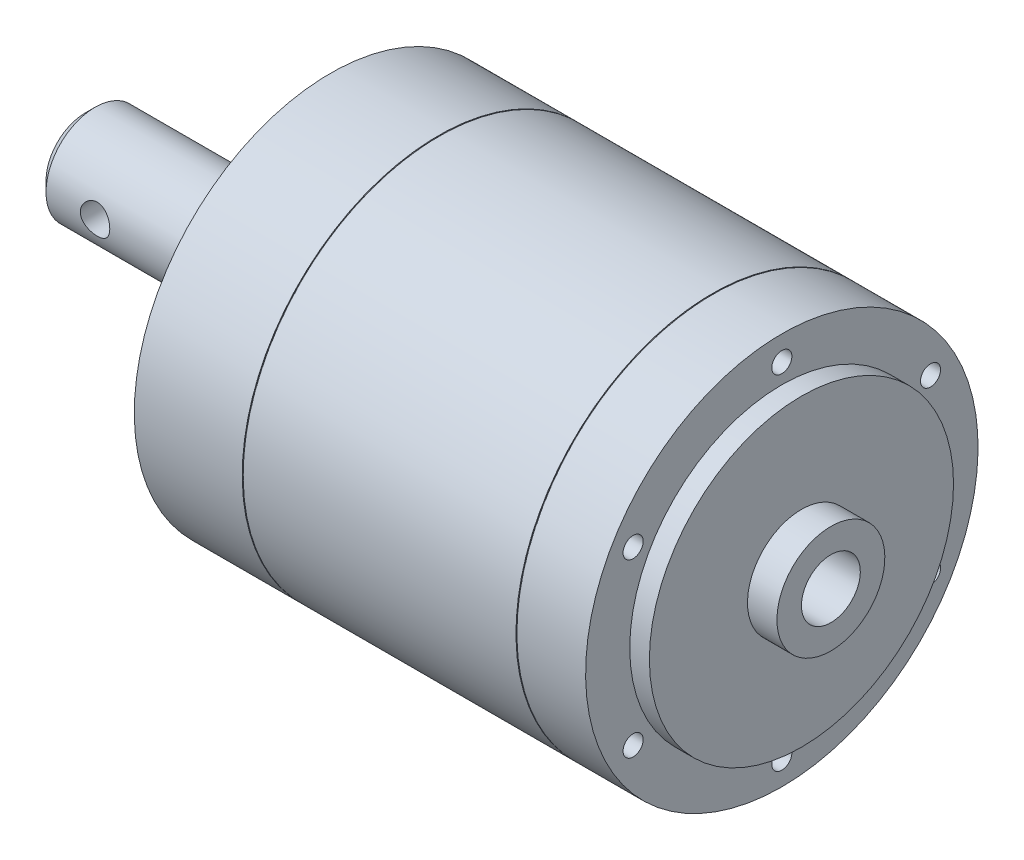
ISO-10303-21;
HEADER;
FILE_DESCRIPTION(('STEP AP214'),'2;1');
FILE_NAME('part.step','',(''),(''),'','','');
FILE_SCHEMA(('AUTOMOTIVE_DESIGN { 1 0 10303 214 1 1 1 1 }'));
ENDSEC;
DATA;
#1=APPLICATION_CONTEXT('core data for automotive mechanical design processes');
#2=APPLICATION_PROTOCOL_DEFINITION('international standard','automotive_design',2000,#1);
#3=PRODUCT_CONTEXT('',#1,'mechanical');
#4=PRODUCT('Part','Part','',(#3));
#5=PRODUCT_RELATED_PRODUCT_CATEGORY('part','',(#4));
#6=PRODUCT_DEFINITION_FORMATION('','',#4);
#7=PRODUCT_DEFINITION_CONTEXT('part definition',#1,'design');
#8=PRODUCT_DEFINITION('design','',#6,#7);
#9=PRODUCT_DEFINITION_SHAPE('','',#8);
#10=(LENGTH_UNIT() NAMED_UNIT(*) SI_UNIT(.MILLI.,.METRE.));
#11=(NAMED_UNIT(*) PLANE_ANGLE_UNIT() SI_UNIT($,.RADIAN.));
#12=(NAMED_UNIT(*) SI_UNIT($,.STERADIAN.) SOLID_ANGLE_UNIT());
#13=UNCERTAINTY_MEASURE_WITH_UNIT(LENGTH_MEASURE(1.E-05),#10,'distance_accuracy_value','');
#14=(GEOMETRIC_REPRESENTATION_CONTEXT(3) GLOBAL_UNCERTAINTY_ASSIGNED_CONTEXT((#13)) GLOBAL_UNIT_ASSIGNED_CONTEXT((#10,
#11,#12)) REPRESENTATION_CONTEXT('',''));
#15=CARTESIAN_POINT('',(0.,0.,0.));
#16=DIRECTION('',(0.,0.,1.));
#17=DIRECTION('',(1.,0.,0.));
#18=AXIS2_PLACEMENT_3D('',#15,#16,#17);
#19=CARTESIAN_POINT('',(-54.,0.,0.));
#20=DIRECTION('',(1.,0.,0.));
#21=DIRECTION('',(0.,1.,0.));
#22=AXIS2_PLACEMENT_3D('',#19,#20,#21);
#23=PLANE('',#22);
#24=CARTESIAN_POINT('',(-54.,0.,0.));
#25=DIRECTION('',(1.,0.,0.));
#26=DIRECTION('',(0.,1.,0.));
#27=AXIS2_PLACEMENT_3D('',#24,#25,#26);
#28=CIRCLE('',#27,11.5);
#29=CARTESIAN_POINT('',(-54.,11.5,0.));
#30=VERTEX_POINT('',#29);
#31=EDGE_CURVE('E243',#30,#30,#28,.F.);
#32=ORIENTED_EDGE('',*,*,#31,.T.);
#33=EDGE_LOOP('',(#32));
#34=FACE_BOUND('',#33,.T.);
#35=CARTESIAN_POINT('',(-54.,0.,0.));
#36=DIRECTION('',(1.,0.,0.));
#37=DIRECTION('',(0.,1.,0.));
#38=AXIS2_PLACEMENT_3D('',#35,#36,#37);
#39=CIRCLE('',#38,5.);
#40=CARTESIAN_POINT('',(-54.,5.,0.));
#41=VERTEX_POINT('',#40);
#42=EDGE_CURVE('E281',#41,#41,#39,.F.);
#43=ORIENTED_EDGE('',*,*,#42,.F.);
#44=EDGE_LOOP('',(#43));
#45=FACE_BOUND('',#44,.T.);
#46=ADVANCED_FACE('F36',(#34,#45),#23,.F.);
#47=CARTESIAN_POINT('',(-92.,0.,0.));
#48=DIRECTION('',(-1.,0.,0.));
#49=DIRECTION('',(0.,-1.,0.));
#50=AXIS2_PLACEMENT_3D('',#47,#48,#49);
#51=CYLINDRICAL_SURFACE('',#50,14.9);
#52=CARTESIAN_POINT('',(-17.1,0.,0.));
#53=DIRECTION('',(-1.,0.,0.));
#54=DIRECTION('',(0.,-1.,0.));
#55=AXIS2_PLACEMENT_3D('',#52,#53,#54);
#56=CIRCLE('',#55,14.9);
#57=CARTESIAN_POINT('',(-17.1,-14.9,0.));
#58=VERTEX_POINT('',#57);
#59=EDGE_CURVE('E247',#58,#58,#56,.T.);
#60=ORIENTED_EDGE('',*,*,#59,.T.);
#61=EDGE_LOOP('',(#60));
#62=FACE_BOUND('',#61,.T.);
#63=CARTESIAN_POINT('',(-10.,0.,0.));
#64=DIRECTION('',(-1.,0.,0.));
#65=DIRECTION('',(0.,-1.,0.));
#66=AXIS2_PLACEMENT_3D('',#63,#64,#65);
#67=CIRCLE('',#66,14.9);
#68=CARTESIAN_POINT('',(-10.,-14.9,0.));
#69=VERTEX_POINT('',#68);
#70=EDGE_CURVE('E239',#69,#69,#67,.T.);
#71=ORIENTED_EDGE('',*,*,#70,.F.);
#72=EDGE_LOOP('',(#71));
#73=FACE_BOUND('',#72,.T.);
#74=ADVANCED_FACE('F307',(#62,#73),#51,.F.);
#75=CARTESIAN_POINT('',(-49.,0.,0.));
#76=DIRECTION('',(1.,0.,0.));
#77=DIRECTION('',(0.,1.,0.));
#78=AXIS2_PLACEMENT_3D('',#75,#76,#77);
#79=PLANE('',#78);
#80=CARTESIAN_POINT('',(-49.,0.,0.));
#81=DIRECTION('',(1.,0.,0.));
#82=DIRECTION('',(0.,1.,0.));
#83=AXIS2_PLACEMENT_3D('',#80,#81,#82);
#84=CIRCLE('',#83,7.);
#85=CARTESIAN_POINT('',(-49.,7.,0.));
#86=VERTEX_POINT('',#85);
#87=EDGE_CURVE('E271',#86,#86,#84,.F.);
#88=ORIENTED_EDGE('',*,*,#87,.F.);
#89=EDGE_LOOP('',(#88));
#90=FACE_BOUND('',#89,.T.);
#91=ADVANCED_FACE('F313',(#90),#79,.T.);
#92=CARTESIAN_POINT('',(-92.,0.,0.));
#93=DIRECTION('',(-1.,0.,0.));
#94=DIRECTION('',(0.,-1.,0.));
#95=AXIS2_PLACEMENT_3D('',#92,#93,#94);
#96=CYLINDRICAL_SURFACE('',#95,7.);
#97=ORIENTED_EDGE('',*,*,#87,.T.);
#98=EDGE_LOOP('',(#97));
#99=FACE_BOUND('',#98,.T.);
#100=CARTESIAN_POINT('',(-46.,0.,0.));
#101=DIRECTION('',(1.,0.,0.));
#102=DIRECTION('',(0.,1.,0.));
#103=AXIS2_PLACEMENT_3D('',#100,#101,#102);
#104=CIRCLE('',#103,7.);
#105=CARTESIAN_POINT('',(-46.,7.,0.));
#106=VERTEX_POINT('',#105);
#107=EDGE_CURVE('E268',#106,#106,#104,.F.);
#108=ORIENTED_EDGE('',*,*,#107,.F.);
#109=EDGE_LOOP('',(#108));
#110=FACE_BOUND('',#109,.T.);
#111=ADVANCED_FACE('F323',(#99,#110),#96,.F.);
#112=CARTESIAN_POINT('',(-46.,12.,0.));
#113=DIRECTION('',(1.,0.,0.));
#114=DIRECTION('',(0.,1.,0.));
#115=AXIS2_PLACEMENT_3D('',#112,#113,#114);
#116=PLANE('',#115);
#117=ORIENTED_EDGE('',*,*,#107,.T.);
#118=EDGE_LOOP('',(#117));
#119=FACE_BOUND('',#118,.T.);
#120=CARTESIAN_POINT('',(-46.,0.,0.));
#121=DIRECTION('',(1.,0.,0.));
#122=DIRECTION('',(0.,1.,0.));
#123=AXIS2_PLACEMENT_3D('',#120,#121,#122);
#124=CIRCLE('',#123,15.);
#125=CARTESIAN_POINT('',(-46.,15.,0.));
#126=VERTEX_POINT('',#125);
#127=EDGE_CURVE('E265',#126,#126,#124,.F.);
#128=ORIENTED_EDGE('',*,*,#127,.F.);
#129=EDGE_LOOP('',(#128));
#130=FACE_BOUND('',#129,.T.);
#131=ADVANCED_FACE('F327',(#119,#130),#116,.T.);
#132=CARTESIAN_POINT('',(-92.,0.,0.));
#133=DIRECTION('',(-1.,0.,0.));
#134=DIRECTION('',(0.,-1.,0.));
#135=AXIS2_PLACEMENT_3D('',#132,#133,#134);
#136=CYLINDRICAL_SURFACE('',#135,15.);
#137=ORIENTED_EDGE('',*,*,#127,.T.);
#138=EDGE_LOOP('',(#137));
#139=FACE_BOUND('',#138,.T.);
#140=CARTESIAN_POINT('',(-45.,0.,0.));
#141=DIRECTION('',(-1.,0.,0.));
#142=DIRECTION('',(0.,-1.,0.));
#143=AXIS2_PLACEMENT_3D('',#140,#141,#142);
#144=CIRCLE('',#143,15.);
#145=CARTESIAN_POINT('',(-45.,-15.,0.));
#146=VERTEX_POINT('',#145);
#147=EDGE_CURVE('E262',#146,#146,#144,.T.);
#148=ORIENTED_EDGE('',*,*,#147,.F.);
#149=EDGE_LOOP('',(#148));
#150=FACE_BOUND('',#149,.T.);
#151=ADVANCED_FACE('F331',(#139,#150),#136,.F.);
#152=CARTESIAN_POINT('',(-45.,20.,0.));
#153=DIRECTION('',(-1.,0.,0.));
#154=DIRECTION('',(0.,-1.,0.));
#155=AXIS2_PLACEMENT_3D('',#152,#153,#154);
#156=PLANE('',#155);
#157=ORIENTED_EDGE('',*,*,#147,.T.);
#158=EDGE_LOOP('',(#157));
#159=FACE_BOUND('',#158,.T.);
#160=CARTESIAN_POINT('',(-45.,0.,0.));
#161=DIRECTION('',(-1.,0.,0.));
#162=DIRECTION('',(0.,-1.,0.));
#163=AXIS2_PLACEMENT_3D('',#160,#161,#162);
#164=CIRCLE('',#163,14.9);
#165=CARTESIAN_POINT('',(-45.,-14.9,0.));
#166=VERTEX_POINT('',#165);
#167=EDGE_CURVE('E259',#166,#166,#164,.T.);
#168=ORIENTED_EDGE('',*,*,#167,.F.);
#169=EDGE_LOOP('',(#168));
#170=FACE_BOUND('',#169,.T.);
#171=ADVANCED_FACE('F335',(#159,#170),#156,.T.);
#172=CARTESIAN_POINT('',(-92.,0.,0.));
#173=DIRECTION('',(-1.,0.,0.));
#174=DIRECTION('',(0.,-1.,0.));
#175=AXIS2_PLACEMENT_3D('',#172,#173,#174);
#176=CYLINDRICAL_SURFACE('',#175,14.9);
#177=ORIENTED_EDGE('',*,*,#167,.T.);
#178=EDGE_LOOP('',(#177));
#179=FACE_BOUND('',#178,.T.);
#180=CARTESIAN_POINT('',(-34.9,0.,0.));
#181=DIRECTION('',(1.,0.,0.));
#182=DIRECTION('',(0.,1.,0.));
#183=AXIS2_PLACEMENT_3D('',#180,#181,#182);
#184=CIRCLE('',#183,14.9);
#185=CARTESIAN_POINT('',(-34.9,14.9,0.));
#186=VERTEX_POINT('',#185);
#187=EDGE_CURVE('E256',#186,#186,#184,.F.);
#188=ORIENTED_EDGE('',*,*,#187,.F.);
#189=EDGE_LOOP('',(#188));
#190=FACE_BOUND('',#189,.T.);
#191=ADVANCED_FACE('F339',(#179,#190),#176,.F.);
#192=CARTESIAN_POINT('',(-34.9,19.9,0.));
#193=DIRECTION('',(1.,0.,0.));
#194=DIRECTION('',(0.,1.,0.));
#195=AXIS2_PLACEMENT_3D('',#192,#193,#194);
#196=PLANE('',#195);
#197=ORIENTED_EDGE('',*,*,#187,.T.);
#198=EDGE_LOOP('',(#197));
#199=FACE_BOUND('',#198,.T.);
#200=CARTESIAN_POINT('',(-34.9,0.,0.));
#201=DIRECTION('',(1.,0.,0.));
#202=DIRECTION('',(0.,1.,0.));
#203=AXIS2_PLACEMENT_3D('',#200,#201,#202);
#204=CIRCLE('',#203,15.);
#205=CARTESIAN_POINT('',(-34.9,15.,0.));
#206=VERTEX_POINT('',#205);
#207=EDGE_CURVE('E253',#206,#206,#204,.F.);
#208=ORIENTED_EDGE('',*,*,#207,.F.);
#209=EDGE_LOOP('',(#208));
#210=FACE_BOUND('',#209,.T.);
#211=ADVANCED_FACE('F343',(#199,#210),#196,.T.);
#212=CARTESIAN_POINT('',(-92.,0.,0.));
#213=DIRECTION('',(-1.,0.,0.));
#214=DIRECTION('',(0.,-1.,0.));
#215=AXIS2_PLACEMENT_3D('',#212,#213,#214);
#216=CYLINDRICAL_SURFACE('',#215,15.);
#217=ORIENTED_EDGE('',*,*,#207,.T.);
#218=EDGE_LOOP('',(#217));
#219=FACE_BOUND('',#218,.T.);
#220=CARTESIAN_POINT('',(-17.1,0.,0.));
#221=DIRECTION('',(-1.,0.,0.));
#222=DIRECTION('',(0.,-1.,0.));
#223=AXIS2_PLACEMENT_3D('',#220,#221,#222);
#224=CIRCLE('',#223,15.);
#225=CARTESIAN_POINT('',(-17.1,-15.,0.));
#226=VERTEX_POINT('',#225);
#227=EDGE_CURVE('E250',#226,#226,#224,.T.);
#228=ORIENTED_EDGE('',*,*,#227,.F.);
#229=EDGE_LOOP('',(#228));
#230=FACE_BOUND('',#229,.T.);
#231=ADVANCED_FACE('F347',(#219,#230),#216,.F.);
#232=CARTESIAN_POINT('',(-17.1,20.,0.));
#233=DIRECTION('',(-1.,0.,0.));
#234=DIRECTION('',(0.,-1.,0.));
#235=AXIS2_PLACEMENT_3D('',#232,#233,#234);
#236=PLANE('',#235);
#237=ORIENTED_EDGE('',*,*,#227,.T.);
#238=EDGE_LOOP('',(#237));
#239=FACE_BOUND('',#238,.T.);
#240=ORIENTED_EDGE('',*,*,#59,.F.);
#241=EDGE_LOOP('',(#240));
#242=FACE_BOUND('',#241,.T.);
#243=ADVANCED_FACE('F351',(#239,#242),#236,.T.);
#244=CARTESIAN_POINT('',(-10.,20.,0.));
#245=DIRECTION('',(-1.,0.,0.));
#246=DIRECTION('',(0.,-1.,0.));
#247=AXIS2_PLACEMENT_3D('',#244,#245,#246);
#248=PLANE('',#247);
#249=ORIENTED_EDGE('',*,*,#70,.T.);
#250=EDGE_LOOP('',(#249));
#251=FACE_BOUND('',#250,.T.);
#252=CARTESIAN_POINT('',(-10.,0.,0.));
#253=DIRECTION('',(-1.,0.,0.));
#254=DIRECTION('',(0.,-1.,0.));
#255=AXIS2_PLACEMENT_3D('',#252,#253,#254);
#256=CIRCLE('',#255,10.5);
#257=CARTESIAN_POINT('',(-10.,-10.5,0.));
#258=VERTEX_POINT('',#257);
#259=EDGE_CURVE('E244',#258,#258,#256,.T.);
#260=ORIENTED_EDGE('',*,*,#259,.F.);
#261=EDGE_LOOP('',(#260));
#262=FACE_BOUND('',#261,.T.);
#263=ADVANCED_FACE('F355',(#251,#262),#248,.T.);
#264=CARTESIAN_POINT('',(-92.,0.,0.));
#265=DIRECTION('',(-1.,0.,0.));
#266=DIRECTION('',(0.,-1.,0.));
#267=AXIS2_PLACEMENT_3D('',#264,#265,#266);
#268=CYLINDRICAL_SURFACE('',#267,10.5);
#269=ORIENTED_EDGE('',*,*,#259,.T.);
#270=EDGE_LOOP('',(#269));
#271=FACE_BOUND('',#270,.T.);
#272=CARTESIAN_POINT('',(-8.00000000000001,0.,0.));
#273=DIRECTION('',(-1.,0.,0.));
#274=DIRECTION('',(0.,-1.,0.));
#275=AXIS2_PLACEMENT_3D('',#272,#273,#274);
#276=CIRCLE('',#275,10.5);
#277=CARTESIAN_POINT('',(-8.00000000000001,-10.5,0.));
#278=VERTEX_POINT('',#277);
#279=EDGE_CURVE('E240',#278,#278,#276,.T.);
#280=ORIENTED_EDGE('',*,*,#279,.F.);
#281=EDGE_LOOP('',(#280));
#282=FACE_BOUND('',#281,.T.);
#283=ADVANCED_FACE('F358',(#271,#282),#268,.F.);
#284=CARTESIAN_POINT('',(-8.,15.5,0.));
#285=DIRECTION('',(-1.,0.,0.));
#286=DIRECTION('',(0.,-1.,0.));
#287=AXIS2_PLACEMENT_3D('',#284,#285,#286);
#288=PLANE('',#287);
#289=CARTESIAN_POINT('',(-8.,0.,0.));
#290=DIRECTION('',(-1.,0.,0.));
#291=DIRECTION('',(0.,-1.,0.));
#292=AXIS2_PLACEMENT_3D('',#289,#290,#291);
#293=CIRCLE('',#292,3.);
#294=CARTESIAN_POINT('',(-8.,-3.,0.));
#295=VERTEX_POINT('',#294);
#296=EDGE_CURVE('E188',#295,#295,#293,.F.);
#297=ORIENTED_EDGE('',*,*,#296,.T.);
#298=EDGE_LOOP('',(#297));
#299=FACE_BOUND('',#298,.T.);
#300=ORIENTED_EDGE('',*,*,#279,.T.);
#301=EDGE_LOOP('',(#300));
#302=FACE_BOUND('',#301,.T.);
#303=ADVANCED_FACE('F38',(#299,#302),#288,.T.);
#304=CARTESIAN_POINT('',(-54.001,0.,0.));
#305=DIRECTION('',(1.,0.,0.));
#306=DIRECTION('',(0.,1.,0.));
#307=AXIS2_PLACEMENT_3D('',#304,#305,#306);
#308=CYLINDRICAL_SURFACE('',#307,3.);
#309=ORIENTED_EDGE('',*,*,#296,.F.);
#310=EDGE_LOOP('',(#309));
#311=FACE_BOUND('',#310,.T.);
#312=CARTESIAN_POINT('',(0.,0.,0.));
#313=DIRECTION('',(1.,0.,0.));
#314=DIRECTION('',(0.,1.,0.));
#315=AXIS2_PLACEMENT_3D('',#312,#313,#314);
#316=CIRCLE('',#315,3.);
#317=CARTESIAN_POINT('',(0.,3.,0.));
#318=VERTEX_POINT('',#317);
#319=EDGE_CURVE('E189',#318,#318,#316,.T.);
#320=ORIENTED_EDGE('',*,*,#319,.T.);
#321=EDGE_LOOP('',(#320));
#322=FACE_BOUND('',#321,.T.);
#323=ADVANCED_FACE('F365',(#311,#322),#308,.F.);
#324=CARTESIAN_POINT('',(-92.,0.,0.));
#325=DIRECTION('',(-1.,0.,0.));
#326=DIRECTION('',(0.,-1.,0.));
#327=AXIS2_PLACEMENT_3D('',#324,#325,#326);
#328=CYLINDRICAL_SURFACE('',#327,12.);
#329=CARTESIAN_POINT('',(-53.5,0.,0.));
#330=DIRECTION('',(1.,0.,0.));
#331=DIRECTION('',(0.,1.,0.));
#332=AXIS2_PLACEMENT_3D('',#329,#330,#331);
#333=CIRCLE('',#332,12.);
#334=CARTESIAN_POINT('',(-53.5,12.,0.));
#335=VERTEX_POINT('',#334);
#336=EDGE_CURVE('E278',#335,#335,#333,.T.);
#337=ORIENTED_EDGE('',*,*,#336,.T.);
#338=EDGE_LOOP('',(#337));
#339=FACE_BOUND('',#338,.T.);
#340=CARTESIAN_POINT('',(-51.,0.,0.));
#341=DIRECTION('',(-1.,0.,0.));
#342=DIRECTION('',(0.,-1.,0.));
#343=AXIS2_PLACEMENT_3D('',#340,#341,#342);
#344=CIRCLE('',#343,12.);
#345=CARTESIAN_POINT('',(-51.,-12.,0.));
#346=VERTEX_POINT('',#345);
#347=EDGE_CURVE('E236',#346,#346,#344,.T.);
#348=ORIENTED_EDGE('',*,*,#347,.T.);
#349=EDGE_LOOP('',(#348));
#350=FACE_BOUND('',#349,.T.);
#351=ADVANCED_FACE('F318',(#339,#350),#328,.T.);
#352=CARTESIAN_POINT('',(-51.,12.,0.));
#353=DIRECTION('',(1.,0.,0.));
#354=DIRECTION('',(0.,1.,0.));
#355=AXIS2_PLACEMENT_3D('',#352,#353,#354);
#356=PLANE('',#355);
#357=CARTESIAN_POINT('',(-51.,12.3743686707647,-12.3743686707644));
#358=DIRECTION('',(-1.,0.,0.));
#359=DIRECTION('',(0.,0.,1.));
#360=AXIS2_PLACEMENT_3D('',#357,#358,#359);
#361=CIRCLE('',#360,1.65);
#362=CARTESIAN_POINT('',(-51.,12.3743686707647,-10.7243686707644));
#363=VERTEX_POINT('',#362);
#364=EDGE_CURVE('E137',#363,#363,#361,.T.);
#365=ORIENTED_EDGE('',*,*,#364,.F.);
#366=EDGE_LOOP('',(#365));
#367=FACE_BOUND('',#366,.T.);
#368=CARTESIAN_POINT('',(-51.,1.8294382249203E-13,-17.5));
#369=DIRECTION('',(-1.,0.,0.));
#370=DIRECTION('',(0.,0.,1.));
#371=AXIS2_PLACEMENT_3D('',#368,#369,#370);
#372=CIRCLE('',#371,1.65);
#373=CARTESIAN_POINT('',(-51.,1.8294382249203E-13,-15.85));
#374=VERTEX_POINT('',#373);
#375=EDGE_CURVE('E143',#374,#374,#372,.T.);
#376=ORIENTED_EDGE('',*,*,#375,.F.);
#377=EDGE_LOOP('',(#376));
#378=FACE_BOUND('',#377,.T.);
#379=CARTESIAN_POINT('',(-51.,-12.3743686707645,-12.3743686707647));
#380=DIRECTION('',(-1.,0.,0.));
#381=DIRECTION('',(0.,0.,1.));
#382=AXIS2_PLACEMENT_3D('',#379,#380,#381);
#383=CIRCLE('',#382,1.65);
#384=CARTESIAN_POINT('',(-51.,-12.3743686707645,-10.7243686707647));
#385=VERTEX_POINT('',#384);
#386=EDGE_CURVE('E149',#385,#385,#383,.T.);
#387=ORIENTED_EDGE('',*,*,#386,.F.);
#388=EDGE_LOOP('',(#387));
#389=FACE_BOUND('',#388,.T.);
#390=CARTESIAN_POINT('',(-51.,-17.5,-1.22201917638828E-13));
#391=DIRECTION('',(-1.,0.,0.));
#392=DIRECTION('',(0.,0.,1.));
#393=AXIS2_PLACEMENT_3D('',#390,#391,#392);
#394=CIRCLE('',#393,1.65);
#395=CARTESIAN_POINT('',(-51.,-17.5,1.64999999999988));
#396=VERTEX_POINT('',#395);
#397=EDGE_CURVE('E155',#396,#396,#394,.T.);
#398=ORIENTED_EDGE('',*,*,#397,.F.);
#399=EDGE_LOOP('',(#398));
#400=FACE_BOUND('',#399,.T.);
#401=CARTESIAN_POINT('',(-51.,-12.3743686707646,12.3743686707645));
#402=DIRECTION('',(-1.,0.,0.));
#403=DIRECTION('',(0.,0.,1.));
#404=AXIS2_PLACEMENT_3D('',#401,#402,#403);
#405=CIRCLE('',#404,1.65);
#406=CARTESIAN_POINT('',(-51.,-12.3743686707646,14.0243686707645));
#407=VERTEX_POINT('',#406);
#408=EDGE_CURVE('E161',#407,#407,#405,.T.);
#409=ORIENTED_EDGE('',*,*,#408,.F.);
#410=EDGE_LOOP('',(#409));
#411=FACE_BOUND('',#410,.T.);
#412=CARTESIAN_POINT('',(-51.,0.,17.5));
#413=DIRECTION('',(-1.,0.,0.));
#414=DIRECTION('',(0.,0.,1.));
#415=AXIS2_PLACEMENT_3D('',#412,#413,#414);
#416=CIRCLE('',#415,1.65);
#417=CARTESIAN_POINT('',(-51.,0.,19.15));
#418=VERTEX_POINT('',#417);
#419=EDGE_CURVE('E167',#418,#418,#416,.T.);
#420=ORIENTED_EDGE('',*,*,#419,.F.);
#421=EDGE_LOOP('',(#420));
#422=FACE_BOUND('',#421,.T.);
#423=CARTESIAN_POINT('',(-51.,12.3743686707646,12.3743686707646));
#424=DIRECTION('',(-1.,0.,0.));
#425=DIRECTION('',(0.,0.,1.));
#426=AXIS2_PLACEMENT_3D('',#423,#424,#425);
#427=CIRCLE('',#426,1.65);
#428=CARTESIAN_POINT('',(-51.,12.3743686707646,14.0243686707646));
#429=VERTEX_POINT('',#428);
#430=EDGE_CURVE('E173',#429,#429,#427,.T.);
#431=ORIENTED_EDGE('',*,*,#430,.F.);
#432=EDGE_LOOP('',(#431));
#433=FACE_BOUND('',#432,.T.);
#434=CARTESIAN_POINT('',(-51.,17.5,0.));
#435=DIRECTION('',(-1.,0.,0.));
#436=DIRECTION('',(0.,0.,1.));
#437=AXIS2_PLACEMENT_3D('',#434,#435,#436);
#438=CIRCLE('',#437,1.65);
#439=CARTESIAN_POINT('',(-51.,17.5,1.65));
#440=VERTEX_POINT('',#439);
#441=EDGE_CURVE('E185',#440,#440,#438,.T.);
#442=ORIENTED_EDGE('',*,*,#441,.F.);
#443=EDGE_LOOP('',(#442));
#444=FACE_BOUND('',#443,.T.);
#445=ORIENTED_EDGE('',*,*,#347,.F.);
#446=EDGE_LOOP('',(#445));
#447=FACE_BOUND('',#446,.T.);
#448=CARTESIAN_POINT('',(-51.,0.,0.));
#449=DIRECTION('',(-1.,0.,0.));
#450=DIRECTION('',(0.,-1.,0.));
#451=AXIS2_PLACEMENT_3D('',#448,#449,#450);
#452=CIRCLE('',#451,20.);
#453=CARTESIAN_POINT('',(-51.,-20.,0.));
#454=VERTEX_POINT('',#453);
#455=EDGE_CURVE('E233',#454,#454,#452,.T.);
#456=ORIENTED_EDGE('',*,*,#455,.T.);
#457=EDGE_LOOP('',(#456));
#458=FACE_BOUND('',#457,.T.);
#459=ADVANCED_FACE('F443',(#367,#378,#389,#400,#411,#422,#433,#444,#447,#458),#356,.F.);
#460=CARTESIAN_POINT('',(-92.,0.,0.));
#461=DIRECTION('',(-1.,0.,0.));
#462=DIRECTION('',(0.,-1.,0.));
#463=AXIS2_PLACEMENT_3D('',#460,#461,#462);
#464=CYLINDRICAL_SURFACE('',#463,20.);
#465=ORIENTED_EDGE('',*,*,#455,.F.);
#466=EDGE_LOOP('',(#465));
#467=FACE_BOUND('',#466,.T.);
#468=CARTESIAN_POINT('',(-40.,0.,0.));
#469=DIRECTION('',(-1.,0.,0.));
#470=DIRECTION('',(0.,-1.,0.));
#471=AXIS2_PLACEMENT_3D('',#468,#469,#470);
#472=CIRCLE('',#471,20.);
#473=CARTESIAN_POINT('',(-40.,-20.,0.));
#474=VERTEX_POINT('',#473);
#475=EDGE_CURVE('E230',#474,#474,#472,.T.);
#476=ORIENTED_EDGE('',*,*,#475,.T.);
#477=EDGE_LOOP('',(#476));
#478=FACE_BOUND('',#477,.T.);
#479=ADVANCED_FACE('F440',(#467,#478),#464,.T.);
#480=CARTESIAN_POINT('',(-40.,20.,0.));
#481=DIRECTION('',(-1.,0.,0.));
#482=DIRECTION('',(0.,-1.,0.));
#483=AXIS2_PLACEMENT_3D('',#480,#481,#482);
#484=PLANE('',#483);
#485=ORIENTED_EDGE('',*,*,#475,.F.);
#486=EDGE_LOOP('',(#485));
#487=FACE_BOUND('',#486,.T.);
#488=CARTESIAN_POINT('',(-40.,0.,0.));
#489=DIRECTION('',(-1.,0.,0.));
#490=DIRECTION('',(0.,-1.,0.));
#491=AXIS2_PLACEMENT_3D('',#488,#489,#490);
#492=CIRCLE('',#491,19.9);
#493=CARTESIAN_POINT('',(-40.,-19.9,0.));
#494=VERTEX_POINT('',#493);
#495=EDGE_CURVE('E227',#494,#494,#492,.T.);
#496=ORIENTED_EDGE('',*,*,#495,.T.);
#497=EDGE_LOOP('',(#496));
#498=FACE_BOUND('',#497,.T.);
#499=ADVANCED_FACE('F436',(#487,#498),#484,.F.);
#500=CARTESIAN_POINT('',(-92.,0.,0.));
#501=DIRECTION('',(-1.,0.,0.));
#502=DIRECTION('',(0.,-1.,0.));
#503=AXIS2_PLACEMENT_3D('',#500,#501,#502);
#504=CYLINDRICAL_SURFACE('',#503,19.9);
#505=ORIENTED_EDGE('',*,*,#495,.F.);
#506=EDGE_LOOP('',(#505));
#507=FACE_BOUND('',#506,.T.);
#508=CARTESIAN_POINT('',(-39.9,0.,0.));
#509=DIRECTION('',(-1.,0.,0.));
#510=DIRECTION('',(0.,-1.,0.));
#511=AXIS2_PLACEMENT_3D('',#508,#509,#510);
#512=CIRCLE('',#511,19.9);
#513=CARTESIAN_POINT('',(-39.9,-19.9,0.));
#514=VERTEX_POINT('',#513);
#515=EDGE_CURVE('E224',#514,#514,#512,.T.);
#516=ORIENTED_EDGE('',*,*,#515,.T.);
#517=EDGE_LOOP('',(#516));
#518=FACE_BOUND('',#517,.T.);
#519=ADVANCED_FACE('F432',(#507,#518),#504,.T.);
#520=CARTESIAN_POINT('',(-39.9,19.9,0.));
#521=DIRECTION('',(1.,0.,0.));
#522=DIRECTION('',(0.,1.,0.));
#523=AXIS2_PLACEMENT_3D('',#520,#521,#522);
#524=PLANE('',#523);
#525=ORIENTED_EDGE('',*,*,#515,.F.);
#526=EDGE_LOOP('',(#525));
#527=FACE_BOUND('',#526,.T.);
#528=CARTESIAN_POINT('',(-39.9,0.,0.));
#529=DIRECTION('',(-1.,0.,0.));
#530=DIRECTION('',(0.,-1.,0.));
#531=AXIS2_PLACEMENT_3D('',#528,#529,#530);
#532=CIRCLE('',#531,20.);
#533=CARTESIAN_POINT('',(-39.9,-20.,0.));
#534=VERTEX_POINT('',#533);
#535=EDGE_CURVE('E221',#534,#534,#532,.T.);
#536=ORIENTED_EDGE('',*,*,#535,.T.);
#537=EDGE_LOOP('',(#536));
#538=FACE_BOUND('',#537,.T.);
#539=ADVANCED_FACE('F428',(#527,#538),#524,.F.);
#540=CARTESIAN_POINT('',(-92.,0.,0.));
#541=DIRECTION('',(-1.,0.,0.));
#542=DIRECTION('',(0.,-1.,0.));
#543=AXIS2_PLACEMENT_3D('',#540,#541,#542);
#544=CYLINDRICAL_SURFACE('',#543,20.);
#545=ORIENTED_EDGE('',*,*,#535,.F.);
#546=EDGE_LOOP('',(#545));
#547=FACE_BOUND('',#546,.T.);
#548=CARTESIAN_POINT('',(-12.1,0.,0.));
#549=DIRECTION('',(-1.,0.,0.));
#550=DIRECTION('',(0.,-1.,0.));
#551=AXIS2_PLACEMENT_3D('',#548,#549,#550);
#552=CIRCLE('',#551,20.);
#553=CARTESIAN_POINT('',(-12.1,-20.,0.));
#554=VERTEX_POINT('',#553);
#555=EDGE_CURVE('E218',#554,#554,#552,.T.);
#556=ORIENTED_EDGE('',*,*,#555,.T.);
#557=EDGE_LOOP('',(#556));
#558=FACE_BOUND('',#557,.T.);
#559=ADVANCED_FACE('F424',(#547,#558),#544,.T.);
#560=CARTESIAN_POINT('',(-12.1,20.,0.));
#561=DIRECTION('',(-1.,0.,0.));
#562=DIRECTION('',(0.,-1.,0.));
#563=AXIS2_PLACEMENT_3D('',#560,#561,#562);
#564=PLANE('',#563);
#565=ORIENTED_EDGE('',*,*,#555,.F.);
#566=EDGE_LOOP('',(#565));
#567=FACE_BOUND('',#566,.T.);
#568=CARTESIAN_POINT('',(-12.1,0.,0.));
#569=DIRECTION('',(-1.,0.,0.));
#570=DIRECTION('',(0.,-1.,0.));
#571=AXIS2_PLACEMENT_3D('',#568,#569,#570);
#572=CIRCLE('',#571,19.9);
#573=CARTESIAN_POINT('',(-12.1,-19.9,0.));
#574=VERTEX_POINT('',#573);
#575=EDGE_CURVE('E215',#574,#574,#572,.T.);
#576=ORIENTED_EDGE('',*,*,#575,.T.);
#577=EDGE_LOOP('',(#576));
#578=FACE_BOUND('',#577,.T.);
#579=ADVANCED_FACE('F420',(#567,#578),#564,.F.);
#580=CARTESIAN_POINT('',(-92.,0.,0.));
#581=DIRECTION('',(-1.,0.,0.));
#582=DIRECTION('',(0.,-1.,0.));
#583=AXIS2_PLACEMENT_3D('',#580,#581,#582);
#584=CYLINDRICAL_SURFACE('',#583,19.9);
#585=ORIENTED_EDGE('',*,*,#575,.F.);
#586=EDGE_LOOP('',(#585));
#587=FACE_BOUND('',#586,.T.);
#588=CARTESIAN_POINT('',(-12.,0.,0.));
#589=DIRECTION('',(-1.,0.,0.));
#590=DIRECTION('',(0.,-1.,0.));
#591=AXIS2_PLACEMENT_3D('',#588,#589,#590);
#592=CIRCLE('',#591,19.9);
#593=CARTESIAN_POINT('',(-12.,-19.9,0.));
#594=VERTEX_POINT('',#593);
#595=EDGE_CURVE('E212',#594,#594,#592,.T.);
#596=ORIENTED_EDGE('',*,*,#595,.T.);
#597=EDGE_LOOP('',(#596));
#598=FACE_BOUND('',#597,.T.);
#599=ADVANCED_FACE('F416',(#587,#598),#584,.T.);
#600=CARTESIAN_POINT('',(-12.,19.9,0.));
#601=DIRECTION('',(1.,0.,0.));
#602=DIRECTION('',(0.,1.,0.));
#603=AXIS2_PLACEMENT_3D('',#600,#601,#602);
#604=PLANE('',#603);
#605=ORIENTED_EDGE('',*,*,#595,.F.);
#606=EDGE_LOOP('',(#605));
#607=FACE_BOUND('',#606,.T.);
#608=CARTESIAN_POINT('',(-12.,0.,0.));
#609=DIRECTION('',(-1.,0.,0.));
#610=DIRECTION('',(0.,-1.,0.));
#611=AXIS2_PLACEMENT_3D('',#608,#609,#610);
#612=CIRCLE('',#611,20.);
#613=CARTESIAN_POINT('',(-12.,-20.,0.));
#614=VERTEX_POINT('',#613);
#615=EDGE_CURVE('E209',#614,#614,#612,.T.);
#616=ORIENTED_EDGE('',*,*,#615,.T.);
#617=EDGE_LOOP('',(#616));
#618=FACE_BOUND('',#617,.T.);
#619=ADVANCED_FACE('F412',(#607,#618),#604,.F.);
#620=CARTESIAN_POINT('',(-92.,0.,0.));
#621=DIRECTION('',(-1.,0.,0.));
#622=DIRECTION('',(0.,-1.,0.));
#623=AXIS2_PLACEMENT_3D('',#620,#621,#622);
#624=CYLINDRICAL_SURFACE('',#623,20.);
#625=ORIENTED_EDGE('',*,*,#615,.F.);
#626=EDGE_LOOP('',(#625));
#627=FACE_BOUND('',#626,.T.);
#628=CARTESIAN_POINT('',(-5.,0.,0.));
#629=DIRECTION('',(-1.,0.,0.));
#630=DIRECTION('',(0.,-1.,0.));
#631=AXIS2_PLACEMENT_3D('',#628,#629,#630);
#632=CIRCLE('',#631,20.);
#633=CARTESIAN_POINT('',(-5.,-20.,0.));
#634=VERTEX_POINT('',#633);
#635=EDGE_CURVE('E206',#634,#634,#632,.T.);
#636=ORIENTED_EDGE('',*,*,#635,.T.);
#637=EDGE_LOOP('',(#636));
#638=FACE_BOUND('',#637,.T.);
#639=ADVANCED_FACE('F408',(#627,#638),#624,.T.);
#640=CARTESIAN_POINT('',(-5.,20.,0.));
#641=DIRECTION('',(-1.,0.,0.));
#642=DIRECTION('',(0.,-1.,0.));
#643=AXIS2_PLACEMENT_3D('',#640,#641,#642);
#644=PLANE('',#643);
#645=CARTESIAN_POINT('',(-5.,8.75000000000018,-15.1554445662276));
#646=DIRECTION('',(1.,0.,0.));
#647=DIRECTION('',(0.,0.,-1.));
#648=AXIS2_PLACEMENT_3D('',#645,#646,#647);
#649=CIRCLE('',#648,1.025);
#650=CARTESIAN_POINT('',(-5.,8.75000000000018,-16.1804445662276));
#651=VERTEX_POINT('',#650);
#652=EDGE_CURVE('E103',#651,#651,#649,.T.);
#653=ORIENTED_EDGE('',*,*,#652,.F.);
#654=EDGE_LOOP('',(#653));
#655=FACE_BOUND('',#654,.T.);
#656=CARTESIAN_POINT('',(-5.,-8.74999999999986,-15.1554445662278));
#657=DIRECTION('',(1.,0.,0.));
#658=DIRECTION('',(0.,0.,-1.));
#659=AXIS2_PLACEMENT_3D('',#656,#657,#658);
#660=CIRCLE('',#659,1.025);
#661=CARTESIAN_POINT('',(-5.,-8.74999999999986,-16.1804445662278));
#662=VERTEX_POINT('',#661);
#663=EDGE_CURVE('E113',#662,#662,#660,.T.);
#664=ORIENTED_EDGE('',*,*,#663,.F.);
#665=EDGE_LOOP('',(#664));
#666=FACE_BOUND('',#665,.T.);
#667=CARTESIAN_POINT('',(-5.,-17.5,-1.22201917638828E-13));
#668=DIRECTION('',(1.,0.,0.));
#669=DIRECTION('',(0.,0.,-1.));
#670=AXIS2_PLACEMENT_3D('',#667,#668,#669);
#671=CIRCLE('',#670,1.025);
#672=CARTESIAN_POINT('',(-5.,-17.5,-1.02500000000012));
#673=VERTEX_POINT('',#672);
#674=EDGE_CURVE('E119',#673,#673,#671,.T.);
#675=ORIENTED_EDGE('',*,*,#674,.F.);
#676=EDGE_LOOP('',(#675));
#677=FACE_BOUND('',#676,.T.);
#678=CARTESIAN_POINT('',(-5.,-8.75000000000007,15.1554445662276));
#679=DIRECTION('',(1.,0.,0.));
#680=DIRECTION('',(0.,0.,-1.));
#681=AXIS2_PLACEMENT_3D('',#678,#679,#680);
#682=CIRCLE('',#681,1.025);
#683=CARTESIAN_POINT('',(-5.,-8.75000000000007,14.1304445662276));
#684=VERTEX_POINT('',#683);
#685=EDGE_CURVE('E125',#684,#684,#682,.T.);
#686=ORIENTED_EDGE('',*,*,#685,.F.);
#687=EDGE_LOOP('',(#686));
#688=FACE_BOUND('',#687,.T.);
#689=CARTESIAN_POINT('',(-5.,8.74999999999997,15.1554445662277));
#690=DIRECTION('',(1.,0.,0.));
#691=DIRECTION('',(0.,0.,-1.));
#692=AXIS2_PLACEMENT_3D('',#689,#690,#691);
#693=CIRCLE('',#692,1.025);
#694=CARTESIAN_POINT('',(-5.,8.74999999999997,14.1304445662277));
#695=VERTEX_POINT('',#694);
#696=EDGE_CURVE('E131',#695,#695,#693,.T.);
#697=ORIENTED_EDGE('',*,*,#696,.F.);
#698=EDGE_LOOP('',(#697));
#699=FACE_BOUND('',#698,.T.);
#700=CARTESIAN_POINT('',(-5.,17.5,0.));
#701=DIRECTION('',(1.,0.,0.));
#702=DIRECTION('',(0.,0.,-1.));
#703=AXIS2_PLACEMENT_3D('',#700,#701,#702);
#704=CIRCLE('',#703,1.025);
#705=CARTESIAN_POINT('',(-5.,17.5,-1.025));
#706=VERTEX_POINT('',#705);
#707=EDGE_CURVE('E179',#706,#706,#704,.T.);
#708=ORIENTED_EDGE('',*,*,#707,.F.);
#709=EDGE_LOOP('',(#708));
#710=FACE_BOUND('',#709,.T.);
#711=ORIENTED_EDGE('',*,*,#635,.F.);
#712=EDGE_LOOP('',(#711));
#713=FACE_BOUND('',#712,.T.);
#714=CARTESIAN_POINT('',(-5.,0.,0.));
#715=DIRECTION('',(-1.,0.,0.));
#716=DIRECTION('',(0.,-1.,0.));
#717=AXIS2_PLACEMENT_3D('',#714,#715,#716);
#718=CIRCLE('',#717,15.5);
#719=CARTESIAN_POINT('',(-5.,-15.5,0.));
#720=VERTEX_POINT('',#719);
#721=EDGE_CURVE('E203',#720,#720,#718,.T.);
#722=ORIENTED_EDGE('',*,*,#721,.T.);
#723=EDGE_LOOP('',(#722));
#724=FACE_BOUND('',#723,.T.);
#725=ADVANCED_FACE('F404',(#655,#666,#677,#688,#699,#710,#713,#724),#644,.F.);
#726=CARTESIAN_POINT('',(-92.,0.,0.));
#727=DIRECTION('',(-1.,0.,0.));
#728=DIRECTION('',(0.,-1.,0.));
#729=AXIS2_PLACEMENT_3D('',#726,#727,#728);
#730=CYLINDRICAL_SURFACE('',#729,15.5);
#731=ORIENTED_EDGE('',*,*,#721,.F.);
#732=EDGE_LOOP('',(#731));
#733=FACE_BOUND('',#732,.T.);
#734=CARTESIAN_POINT('',(-3.,0.,0.));
#735=DIRECTION('',(-1.,0.,0.));
#736=DIRECTION('',(0.,-1.,0.));
#737=AXIS2_PLACEMENT_3D('',#734,#735,#736);
#738=CIRCLE('',#737,15.5);
#739=CARTESIAN_POINT('',(-3.,-15.5,0.));
#740=VERTEX_POINT('',#739);
#741=EDGE_CURVE('E200',#740,#740,#738,.T.);
#742=ORIENTED_EDGE('',*,*,#741,.T.);
#743=EDGE_LOOP('',(#742));
#744=FACE_BOUND('',#743,.T.);
#745=ADVANCED_FACE('F396',(#733,#744),#730,.T.);
#746=CARTESIAN_POINT('',(-3.,15.5,0.));
#747=DIRECTION('',(-1.,0.,0.));
#748=DIRECTION('',(0.,-1.,0.));
#749=AXIS2_PLACEMENT_3D('',#746,#747,#748);
#750=PLANE('',#749);
#751=ORIENTED_EDGE('',*,*,#741,.F.);
#752=EDGE_LOOP('',(#751));
#753=FACE_BOUND('',#752,.T.);
#754=CARTESIAN_POINT('',(-3.,0.,0.));
#755=DIRECTION('',(-1.,0.,0.));
#756=DIRECTION('',(0.,-1.,0.));
#757=AXIS2_PLACEMENT_3D('',#754,#755,#756);
#758=CIRCLE('',#757,5.5);
#759=CARTESIAN_POINT('',(-3.,-5.5,0.));
#760=VERTEX_POINT('',#759);
#761=EDGE_CURVE('E197',#760,#760,#758,.T.);
#762=ORIENTED_EDGE('',*,*,#761,.T.);
#763=EDGE_LOOP('',(#762));
#764=FACE_BOUND('',#763,.T.);
#765=ADVANCED_FACE('F390',(#753,#764),#750,.F.);
#766=CARTESIAN_POINT('',(-92.,0.,0.));
#767=DIRECTION('',(-1.,0.,0.));
#768=DIRECTION('',(0.,-1.,0.));
#769=AXIS2_PLACEMENT_3D('',#766,#767,#768);
#770=CYLINDRICAL_SURFACE('',#769,5.5);
#771=ORIENTED_EDGE('',*,*,#761,.F.);
#772=EDGE_LOOP('',(#771));
#773=FACE_BOUND('',#772,.T.);
#774=CARTESIAN_POINT('',(0.,0.,0.));
#775=DIRECTION('',(-1.,0.,0.));
#776=DIRECTION('',(0.,-1.,0.));
#777=AXIS2_PLACEMENT_3D('',#774,#775,#776);
#778=CIRCLE('',#777,5.5);
#779=CARTESIAN_POINT('',(0.,-5.5,0.));
#780=VERTEX_POINT('',#779);
#781=EDGE_CURVE('E192',#780,#780,#778,.T.);
#782=ORIENTED_EDGE('',*,*,#781,.T.);
#783=EDGE_LOOP('',(#782));
#784=FACE_BOUND('',#783,.T.);
#785=ADVANCED_FACE('F385',(#773,#784),#770,.T.);
#786=CARTESIAN_POINT('',(0.,5.5,0.));
#787=DIRECTION('',(-1.,0.,0.));
#788=DIRECTION('',(0.,-1.,0.));
#789=AXIS2_PLACEMENT_3D('',#786,#787,#788);
#790=PLANE('',#789);
#791=ORIENTED_EDGE('',*,*,#319,.F.);
#792=EDGE_LOOP('',(#791));
#793=FACE_BOUND('',#792,.T.);
#794=ORIENTED_EDGE('',*,*,#781,.F.);
#795=EDGE_LOOP('',(#794));
#796=FACE_BOUND('',#795,.T.);
#797=ADVANCED_FACE('F381',(#793,#796),#790,.F.);
#798=CARTESIAN_POINT('',(-54.,0.,0.));
#799=DIRECTION('',(1.,0.,0.));
#800=DIRECTION('',(0.,1.,0.));
#801=AXIS2_PLACEMENT_3D('',#798,#799,#800);
#802=CONICAL_SURFACE('',#801,11.5,0.785398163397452);
#803=ORIENTED_EDGE('',*,*,#336,.F.);
#804=EDGE_LOOP('',(#803));
#805=FACE_BOUND('',#804,.T.);
#806=ORIENTED_EDGE('',*,*,#31,.F.);
#807=EDGE_LOOP('',(#806));
#808=FACE_BOUND('',#807,.T.);
#809=ADVANCED_FACE('F384',(#805,#808),#802,.T.);
#810=CARTESIAN_POINT('',(-51.,17.5,0.));
#811=DIRECTION('',(-1.,0.,0.));
#812=DIRECTION('',(0.,0.,1.));
#813=AXIS2_PLACEMENT_3D('',#810,#811,#812);
#814=CYLINDRICAL_SURFACE('',#813,1.65);
#815=CARTESIAN_POINT('',(-39.5,17.5,0.));
#816=DIRECTION('',(-1.,0.,0.));
#817=DIRECTION('',(0.,0.,1.));
#818=AXIS2_PLACEMENT_3D('',#815,#816,#817);
#819=CIRCLE('',#818,1.65);
#820=CARTESIAN_POINT('',(-39.5,17.5,1.65));
#821=VERTEX_POINT('',#820);
#822=EDGE_CURVE('E182',#821,#821,#819,.T.);
#823=ORIENTED_EDGE('',*,*,#822,.F.);
#824=EDGE_LOOP('',(#823));
#825=FACE_BOUND('',#824,.T.);
#826=ORIENTED_EDGE('',*,*,#441,.T.);
#827=EDGE_LOOP('',(#826));
#828=FACE_BOUND('',#827,.T.);
#829=ADVANCED_FACE('F496',(#825,#828),#814,.F.);
#830=CARTESIAN_POINT('',(-39.5,17.5,0.));
#831=DIRECTION('',(-1.,0.,0.));
#832=DIRECTION('',(0.,0.,1.));
#833=AXIS2_PLACEMENT_3D('',#830,#831,#832);
#834=CONICAL_SURFACE('',#833,1.65,1.0471975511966);
#835=CARTESIAN_POINT('',(-38.5473720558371,17.5,0.));
#836=VERTEX_POINT('',#835);
#837=VERTEX_LOOP('',#836);
#838=FACE_BOUND('',#837,.T.);
#839=ORIENTED_EDGE('',*,*,#822,.T.);
#840=EDGE_LOOP('',(#839));
#841=FACE_BOUND('',#840,.T.);
#842=ADVANCED_FACE('F498',(#838,#841),#834,.F.);
#843=CARTESIAN_POINT('',(-5.,17.5,0.));
#844=DIRECTION('',(1.,0.,0.));
#845=DIRECTION('',(0.,0.,-1.));
#846=AXIS2_PLACEMENT_3D('',#843,#844,#845);
#847=CYLINDRICAL_SURFACE('',#846,1.025);
#848=CARTESIAN_POINT('',(-25.,17.5,0.));
#849=DIRECTION('',(1.,0.,0.));
#850=DIRECTION('',(0.,0.,-1.));
#851=AXIS2_PLACEMENT_3D('',#848,#849,#850);
#852=CIRCLE('',#851,1.02499999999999);
#853=CARTESIAN_POINT('',(-25.,17.5,-1.02499999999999));
#854=VERTEX_POINT('',#853);
#855=EDGE_CURVE('E176',#854,#854,#852,.T.);
#856=ORIENTED_EDGE('',*,*,#855,.F.);
#857=EDGE_LOOP('',(#856));
#858=FACE_BOUND('',#857,.T.);
#859=ORIENTED_EDGE('',*,*,#707,.T.);
#860=EDGE_LOOP('',(#859));
#861=FACE_BOUND('',#860,.T.);
#862=ADVANCED_FACE('F505',(#858,#861),#847,.F.);
#863=CARTESIAN_POINT('',(-25.,17.5,0.));
#864=DIRECTION('',(1.,0.,0.));
#865=DIRECTION('',(0.,0.,-1.));
#866=AXIS2_PLACEMENT_3D('',#863,#864,#865);
#867=CONICAL_SURFACE('',#866,1.02499999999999,1.04719755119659);
#868=CARTESIAN_POINT('',(-25.5917840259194,17.5,0.));
#869=VERTEX_POINT('',#868);
#870=VERTEX_LOOP('',#869);
#871=FACE_BOUND('',#870,.T.);
#872=ORIENTED_EDGE('',*,*,#855,.T.);
#873=EDGE_LOOP('',(#872));
#874=FACE_BOUND('',#873,.T.);
#875=ADVANCED_FACE('F512',(#871,#874),#867,.F.);
#876=CARTESIAN_POINT('',(-51.,12.3743686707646,12.3743686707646));
#877=DIRECTION('',(-1.,0.,0.));
#878=DIRECTION('',(0.,0.,1.));
#879=AXIS2_PLACEMENT_3D('',#876,#877,#878);
#880=CYLINDRICAL_SURFACE('',#879,1.65);
#881=CARTESIAN_POINT('',(-39.5,12.3743686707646,12.3743686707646));
#882=DIRECTION('',(-1.,0.,0.));
#883=DIRECTION('',(0.,0.,1.));
#884=AXIS2_PLACEMENT_3D('',#881,#882,#883);
#885=CIRCLE('',#884,1.65);
#886=CARTESIAN_POINT('',(-39.5,12.3743686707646,14.0243686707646));
#887=VERTEX_POINT('',#886);
#888=EDGE_CURVE('E170',#887,#887,#885,.T.);
#889=ORIENTED_EDGE('',*,*,#888,.F.);
#890=EDGE_LOOP('',(#889));
#891=FACE_BOUND('',#890,.T.);
#892=ORIENTED_EDGE('',*,*,#430,.T.);
#893=EDGE_LOOP('',(#892));
#894=FACE_BOUND('',#893,.T.);
#895=ADVANCED_FACE('F516',(#891,#894),#880,.F.);
#896=CARTESIAN_POINT('',(-39.5,12.3743686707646,12.3743686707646));
#897=DIRECTION('',(-1.,0.,0.));
#898=DIRECTION('',(0.,0.,1.));
#899=AXIS2_PLACEMENT_3D('',#896,#897,#898);
#900=CONICAL_SURFACE('',#899,1.65,1.0471975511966);
#901=CARTESIAN_POINT('',(-38.5473720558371,12.3743686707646,12.3743686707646));
#902=VERTEX_POINT('',#901);
#903=VERTEX_LOOP('',#902);
#904=FACE_BOUND('',#903,.T.);
#905=ORIENTED_EDGE('',*,*,#888,.T.);
#906=EDGE_LOOP('',(#905));
#907=FACE_BOUND('',#906,.T.);
#908=ADVANCED_FACE('F519',(#904,#907),#900,.F.);
#909=CARTESIAN_POINT('',(-51.,0.,17.5));
#910=DIRECTION('',(-1.,0.,0.));
#911=DIRECTION('',(0.,0.,1.));
#912=AXIS2_PLACEMENT_3D('',#909,#910,#911);
#913=CYLINDRICAL_SURFACE('',#912,1.65);
#914=CARTESIAN_POINT('',(-39.5,0.,17.5));
#915=DIRECTION('',(-1.,0.,0.));
#916=DIRECTION('',(0.,0.,1.));
#917=AXIS2_PLACEMENT_3D('',#914,#915,#916);
#918=CIRCLE('',#917,1.65);
#919=CARTESIAN_POINT('',(-39.5,0.,19.15));
#920=VERTEX_POINT('',#919);
#921=EDGE_CURVE('E164',#920,#920,#918,.T.);
#922=ORIENTED_EDGE('',*,*,#921,.F.);
#923=EDGE_LOOP('',(#922));
#924=FACE_BOUND('',#923,.T.);
#925=ORIENTED_EDGE('',*,*,#419,.T.);
#926=EDGE_LOOP('',(#925));
#927=FACE_BOUND('',#926,.T.);
#928=ADVANCED_FACE('F523',(#924,#927),#913,.F.);
#929=CARTESIAN_POINT('',(-39.5,0.,17.5));
#930=DIRECTION('',(-1.,0.,0.));
#931=DIRECTION('',(0.,0.,1.));
#932=AXIS2_PLACEMENT_3D('',#929,#930,#931);
#933=CONICAL_SURFACE('',#932,1.65,1.0471975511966);
#934=CARTESIAN_POINT('',(-38.5473720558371,0.,17.5));
#935=VERTEX_POINT('',#934);
#936=VERTEX_LOOP('',#935);
#937=FACE_BOUND('',#936,.T.);
#938=ORIENTED_EDGE('',*,*,#921,.T.);
#939=EDGE_LOOP('',(#938));
#940=FACE_BOUND('',#939,.T.);
#941=ADVANCED_FACE('F527',(#937,#940),#933,.F.);
#942=CARTESIAN_POINT('',(-51.,-12.3743686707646,12.3743686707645));
#943=DIRECTION('',(-1.,0.,0.));
#944=DIRECTION('',(0.,0.,1.));
#945=AXIS2_PLACEMENT_3D('',#942,#943,#944);
#946=CYLINDRICAL_SURFACE('',#945,1.65);
#947=CARTESIAN_POINT('',(-39.5,-12.3743686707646,12.3743686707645));
#948=DIRECTION('',(-1.,0.,0.));
#949=DIRECTION('',(0.,0.,1.));
#950=AXIS2_PLACEMENT_3D('',#947,#948,#949);
#951=CIRCLE('',#950,1.65);
#952=CARTESIAN_POINT('',(-39.5,-12.3743686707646,14.0243686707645));
#953=VERTEX_POINT('',#952);
#954=EDGE_CURVE('E158',#953,#953,#951,.T.);
#955=ORIENTED_EDGE('',*,*,#954,.F.);
#956=EDGE_LOOP('',(#955));
#957=FACE_BOUND('',#956,.T.);
#958=ORIENTED_EDGE('',*,*,#408,.T.);
#959=EDGE_LOOP('',(#958));
#960=FACE_BOUND('',#959,.T.);
#961=ADVANCED_FACE('F531',(#957,#960),#946,.F.);
#962=CARTESIAN_POINT('',(-39.5,-12.3743686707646,12.3743686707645));
#963=DIRECTION('',(-1.,0.,0.));
#964=DIRECTION('',(0.,0.,1.));
#965=AXIS2_PLACEMENT_3D('',#962,#963,#964);
#966=CONICAL_SURFACE('',#965,1.65,1.0471975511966);
#967=CARTESIAN_POINT('',(-38.5473720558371,-12.3743686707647,12.3743686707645));
#968=VERTEX_POINT('',#967);
#969=VERTEX_LOOP('',#968);
#970=FACE_BOUND('',#969,.T.);
#971=ORIENTED_EDGE('',*,*,#954,.T.);
#972=EDGE_LOOP('',(#971));
#973=FACE_BOUND('',#972,.T.);
#974=ADVANCED_FACE('F535',(#970,#973),#966,.F.);
#975=CARTESIAN_POINT('',(-51.,-17.5,-1.22201917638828E-13));
#976=DIRECTION('',(-1.,0.,0.));
#977=DIRECTION('',(0.,0.,1.));
#978=AXIS2_PLACEMENT_3D('',#975,#976,#977);
#979=CYLINDRICAL_SURFACE('',#978,1.65);
#980=CARTESIAN_POINT('',(-39.5,-17.5,-1.22201917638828E-13));
#981=DIRECTION('',(-1.,0.,0.));
#982=DIRECTION('',(0.,0.,1.));
#983=AXIS2_PLACEMENT_3D('',#980,#981,#982);
#984=CIRCLE('',#983,1.65);
#985=CARTESIAN_POINT('',(-39.5,-17.5,1.64999999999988));
#986=VERTEX_POINT('',#985);
#987=EDGE_CURVE('E152',#986,#986,#984,.T.);
#988=ORIENTED_EDGE('',*,*,#987,.F.);
#989=EDGE_LOOP('',(#988));
#990=FACE_BOUND('',#989,.T.);
#991=ORIENTED_EDGE('',*,*,#397,.T.);
#992=EDGE_LOOP('',(#991));
#993=FACE_BOUND('',#992,.T.);
#994=ADVANCED_FACE('F539',(#990,#993),#979,.F.);
#995=CARTESIAN_POINT('',(-39.5,-17.5,-1.22201917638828E-13));
#996=DIRECTION('',(-1.,0.,0.));
#997=DIRECTION('',(0.,0.,1.));
#998=AXIS2_PLACEMENT_3D('',#995,#996,#997);
#999=CONICAL_SURFACE('',#998,1.65,1.0471975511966);
#1000=CARTESIAN_POINT('',(-38.5473720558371,-17.5,-1.22201917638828E-13));
#1001=VERTEX_POINT('',#1000);
#1002=VERTEX_LOOP('',#1001);
#1003=FACE_BOUND('',#1002,.T.);
#1004=ORIENTED_EDGE('',*,*,#987,.T.);
#1005=EDGE_LOOP('',(#1004));
#1006=FACE_BOUND('',#1005,.T.);
#1007=ADVANCED_FACE('F543',(#1003,#1006),#999,.F.);
#1008=CARTESIAN_POINT('',(-51.,-12.3743686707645,-12.3743686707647));
#1009=DIRECTION('',(-1.,0.,0.));
#1010=DIRECTION('',(0.,0.,1.));
#1011=AXIS2_PLACEMENT_3D('',#1008,#1009,#1010);
#1012=CYLINDRICAL_SURFACE('',#1011,1.65);
#1013=CARTESIAN_POINT('',(-39.5,-12.3743686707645,-12.3743686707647));
#1014=DIRECTION('',(-1.,0.,0.));
#1015=DIRECTION('',(0.,0.,1.));
#1016=AXIS2_PLACEMENT_3D('',#1013,#1014,#1015);
#1017=CIRCLE('',#1016,1.65);
#1018=CARTESIAN_POINT('',(-39.5,-12.3743686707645,-10.7243686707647));
#1019=VERTEX_POINT('',#1018);
#1020=EDGE_CURVE('E146',#1019,#1019,#1017,.T.);
#1021=ORIENTED_EDGE('',*,*,#1020,.F.);
#1022=EDGE_LOOP('',(#1021));
#1023=FACE_BOUND('',#1022,.T.);
#1024=ORIENTED_EDGE('',*,*,#386,.T.);
#1025=EDGE_LOOP('',(#1024));
#1026=FACE_BOUND('',#1025,.T.);
#1027=ADVANCED_FACE('F547',(#1023,#1026),#1012,.F.);
#1028=CARTESIAN_POINT('',(-39.5,-12.3743686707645,-12.3743686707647));
#1029=DIRECTION('',(-1.,0.,0.));
#1030=DIRECTION('',(0.,0.,1.));
#1031=AXIS2_PLACEMENT_3D('',#1028,#1029,#1030);
#1032=CONICAL_SURFACE('',#1031,1.65,1.0471975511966);
#1033=CARTESIAN_POINT('',(-38.5473720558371,-12.3743686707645,-12.3743686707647));
#1034=VERTEX_POINT('',#1033);
#1035=VERTEX_LOOP('',#1034);
#1036=FACE_BOUND('',#1035,.T.);
#1037=ORIENTED_EDGE('',*,*,#1020,.T.);
#1038=EDGE_LOOP('',(#1037));
#1039=FACE_BOUND('',#1038,.T.);
#1040=ADVANCED_FACE('F551',(#1036,#1039),#1032,.F.);
#1041=CARTESIAN_POINT('',(-51.,1.8294382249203E-13,-17.5));
#1042=DIRECTION('',(-1.,0.,0.));
#1043=DIRECTION('',(0.,0.,1.));
#1044=AXIS2_PLACEMENT_3D('',#1041,#1042,#1043);
#1045=CYLINDRICAL_SURFACE('',#1044,1.65);
#1046=CARTESIAN_POINT('',(-39.5,1.8294382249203E-13,-17.5));
#1047=DIRECTION('',(-1.,0.,0.));
#1048=DIRECTION('',(0.,0.,1.));
#1049=AXIS2_PLACEMENT_3D('',#1046,#1047,#1048);
#1050=CIRCLE('',#1049,1.65);
#1051=CARTESIAN_POINT('',(-39.5,1.8294382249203E-13,-15.85));
#1052=VERTEX_POINT('',#1051);
#1053=EDGE_CURVE('E140',#1052,#1052,#1050,.T.);
#1054=ORIENTED_EDGE('',*,*,#1053,.F.);
#1055=EDGE_LOOP('',(#1054));
#1056=FACE_BOUND('',#1055,.T.);
#1057=ORIENTED_EDGE('',*,*,#375,.T.);
#1058=EDGE_LOOP('',(#1057));
#1059=FACE_BOUND('',#1058,.T.);
#1060=ADVANCED_FACE('F555',(#1056,#1059),#1045,.F.);
#1061=CARTESIAN_POINT('',(-39.5,1.8294382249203E-13,-17.5));
#1062=DIRECTION('',(-1.,0.,0.));
#1063=DIRECTION('',(0.,0.,1.));
#1064=AXIS2_PLACEMENT_3D('',#1061,#1062,#1063);
#1065=CONICAL_SURFACE('',#1064,1.65,1.0471975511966);
#1066=CARTESIAN_POINT('',(-38.5473720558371,1.79987295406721E-13,-17.5));
#1067=VERTEX_POINT('',#1066);
#1068=VERTEX_LOOP('',#1067);
#1069=FACE_BOUND('',#1068,.T.);
#1070=ORIENTED_EDGE('',*,*,#1053,.T.);
#1071=EDGE_LOOP('',(#1070));
#1072=FACE_BOUND('',#1071,.T.);
#1073=ADVANCED_FACE('F559',(#1069,#1072),#1065,.F.);
#1074=CARTESIAN_POINT('',(-51.,12.3743686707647,-12.3743686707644));
#1075=DIRECTION('',(-1.,0.,0.));
#1076=DIRECTION('',(0.,0.,1.));
#1077=AXIS2_PLACEMENT_3D('',#1074,#1075,#1076);
#1078=CYLINDRICAL_SURFACE('',#1077,1.65);
#1079=CARTESIAN_POINT('',(-39.5,12.3743686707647,-12.3743686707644));
#1080=DIRECTION('',(-1.,0.,0.));
#1081=DIRECTION('',(0.,0.,1.));
#1082=AXIS2_PLACEMENT_3D('',#1079,#1080,#1081);
#1083=CIRCLE('',#1082,1.65);
#1084=CARTESIAN_POINT('',(-39.5,12.3743686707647,-10.7243686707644));
#1085=VERTEX_POINT('',#1084);
#1086=EDGE_CURVE('E134',#1085,#1085,#1083,.T.);
#1087=ORIENTED_EDGE('',*,*,#1086,.F.);
#1088=EDGE_LOOP('',(#1087));
#1089=FACE_BOUND('',#1088,.T.);
#1090=ORIENTED_EDGE('',*,*,#364,.T.);
#1091=EDGE_LOOP('',(#1090));
#1092=FACE_BOUND('',#1091,.T.);
#1093=ADVANCED_FACE('F563',(#1089,#1092),#1078,.F.);
#1094=CARTESIAN_POINT('',(-39.5,12.3743686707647,-12.3743686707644));
#1095=DIRECTION('',(-1.,0.,0.));
#1096=DIRECTION('',(0.,0.,1.));
#1097=AXIS2_PLACEMENT_3D('',#1094,#1095,#1096);
#1098=CONICAL_SURFACE('',#1097,1.65,1.0471975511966);
#1099=CARTESIAN_POINT('',(-38.5473720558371,12.3743686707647,-12.3743686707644));
#1100=VERTEX_POINT('',#1099);
#1101=VERTEX_LOOP('',#1100);
#1102=FACE_BOUND('',#1101,.T.);
#1103=ORIENTED_EDGE('',*,*,#1086,.T.);
#1104=EDGE_LOOP('',(#1103));
#1105=FACE_BOUND('',#1104,.T.);
#1106=ADVANCED_FACE('F567',(#1102,#1105),#1098,.F.);
#1107=CARTESIAN_POINT('',(-5.,8.74999999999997,15.1554445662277));
#1108=DIRECTION('',(1.,0.,0.));
#1109=DIRECTION('',(0.,0.,-1.));
#1110=AXIS2_PLACEMENT_3D('',#1107,#1108,#1109);
#1111=CYLINDRICAL_SURFACE('',#1110,1.025);
#1112=CARTESIAN_POINT('',(-25.,8.74999999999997,15.1554445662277));
#1113=DIRECTION('',(1.,0.,0.));
#1114=DIRECTION('',(0.,0.,-1.));
#1115=AXIS2_PLACEMENT_3D('',#1112,#1113,#1114);
#1116=CIRCLE('',#1115,1.02499999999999);
#1117=CARTESIAN_POINT('',(-25.,8.74999999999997,14.1304445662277));
#1118=VERTEX_POINT('',#1117);
#1119=EDGE_CURVE('E128',#1118,#1118,#1116,.T.);
#1120=ORIENTED_EDGE('',*,*,#1119,.F.);
#1121=EDGE_LOOP('',(#1120));
#1122=FACE_BOUND('',#1121,.T.);
#1123=ORIENTED_EDGE('',*,*,#696,.T.);
#1124=EDGE_LOOP('',(#1123));
#1125=FACE_BOUND('',#1124,.T.);
#1126=ADVANCED_FACE('F571',(#1122,#1125),#1111,.F.);
#1127=CARTESIAN_POINT('',(-25.,8.74999999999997,15.1554445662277));
#1128=DIRECTION('',(1.,0.,0.));
#1129=DIRECTION('',(0.,0.,-1.));
#1130=AXIS2_PLACEMENT_3D('',#1127,#1128,#1129);
#1131=CONICAL_SURFACE('',#1130,1.02499999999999,1.04719755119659);
#1132=CARTESIAN_POINT('',(-25.5917840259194,8.74999999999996,15.1554445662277));
#1133=VERTEX_POINT('',#1132);
#1134=VERTEX_LOOP('',#1133);
#1135=FACE_BOUND('',#1134,.T.);
#1136=ORIENTED_EDGE('',*,*,#1119,.T.);
#1137=EDGE_LOOP('',(#1136));
#1138=FACE_BOUND('',#1137,.T.);
#1139=ADVANCED_FACE('F575',(#1135,#1138),#1131,.F.);
#1140=CARTESIAN_POINT('',(-5.,-8.75000000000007,15.1554445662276));
#1141=DIRECTION('',(1.,0.,0.));
#1142=DIRECTION('',(0.,0.,-1.));
#1143=AXIS2_PLACEMENT_3D('',#1140,#1141,#1142);
#1144=CYLINDRICAL_SURFACE('',#1143,1.025);
#1145=CARTESIAN_POINT('',(-25.,-8.75000000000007,15.1554445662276));
#1146=DIRECTION('',(1.,0.,0.));
#1147=DIRECTION('',(0.,0.,-1.));
#1148=AXIS2_PLACEMENT_3D('',#1145,#1146,#1147);
#1149=CIRCLE('',#1148,1.02499999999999);
#1150=CARTESIAN_POINT('',(-25.,-8.75000000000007,14.1304445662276));
#1151=VERTEX_POINT('',#1150);
#1152=EDGE_CURVE('E122',#1151,#1151,#1149,.T.);
#1153=ORIENTED_EDGE('',*,*,#1152,.F.);
#1154=EDGE_LOOP('',(#1153));
#1155=FACE_BOUND('',#1154,.T.);
#1156=ORIENTED_EDGE('',*,*,#685,.T.);
#1157=EDGE_LOOP('',(#1156));
#1158=FACE_BOUND('',#1157,.T.);
#1159=ADVANCED_FACE('F579',(#1155,#1158),#1144,.F.);
#1160=CARTESIAN_POINT('',(-25.,-8.75000000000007,15.1554445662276));
#1161=DIRECTION('',(1.,0.,0.));
#1162=DIRECTION('',(0.,0.,-1.));
#1163=AXIS2_PLACEMENT_3D('',#1160,#1161,#1162);
#1164=CONICAL_SURFACE('',#1163,1.02499999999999,1.04719755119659);
#1165=CARTESIAN_POINT('',(-25.5917840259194,-8.75000000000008,15.1554445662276));
#1166=VERTEX_POINT('',#1165);
#1167=VERTEX_LOOP('',#1166);
#1168=FACE_BOUND('',#1167,.T.);
#1169=ORIENTED_EDGE('',*,*,#1152,.T.);
#1170=EDGE_LOOP('',(#1169));
#1171=FACE_BOUND('',#1170,.T.);
#1172=ADVANCED_FACE('F583',(#1168,#1171),#1164,.F.);
#1173=CARTESIAN_POINT('',(-5.,-17.5,-1.22201917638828E-13));
#1174=DIRECTION('',(1.,0.,0.));
#1175=DIRECTION('',(0.,0.,-1.));
#1176=AXIS2_PLACEMENT_3D('',#1173,#1174,#1175);
#1177=CYLINDRICAL_SURFACE('',#1176,1.025);
#1178=CARTESIAN_POINT('',(-25.,-17.5,-1.22201917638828E-13));
#1179=DIRECTION('',(1.,0.,0.));
#1180=DIRECTION('',(0.,0.,-1.));
#1181=AXIS2_PLACEMENT_3D('',#1178,#1179,#1180);
#1182=CIRCLE('',#1181,1.02499999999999);
#1183=CARTESIAN_POINT('',(-25.,-17.5,-1.02500000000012));
#1184=VERTEX_POINT('',#1183);
#1185=EDGE_CURVE('E116',#1184,#1184,#1182,.T.);
#1186=ORIENTED_EDGE('',*,*,#1185,.F.);
#1187=EDGE_LOOP('',(#1186));
#1188=FACE_BOUND('',#1187,.T.);
#1189=ORIENTED_EDGE('',*,*,#674,.T.);
#1190=EDGE_LOOP('',(#1189));
#1191=FACE_BOUND('',#1190,.T.);
#1192=ADVANCED_FACE('F587',(#1188,#1191),#1177,.F.);
#1193=CARTESIAN_POINT('',(-25.,-17.5,-1.22201917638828E-13));
#1194=DIRECTION('',(1.,0.,0.));
#1195=DIRECTION('',(0.,0.,-1.));
#1196=AXIS2_PLACEMENT_3D('',#1193,#1194,#1195);
#1197=CONICAL_SURFACE('',#1196,1.02499999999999,1.04719755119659);
#1198=CARTESIAN_POINT('',(-25.5917840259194,-17.5,-1.22201917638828E-13));
#1199=VERTEX_POINT('',#1198);
#1200=VERTEX_LOOP('',#1199);
#1201=FACE_BOUND('',#1200,.T.);
#1202=ORIENTED_EDGE('',*,*,#1185,.T.);
#1203=EDGE_LOOP('',(#1202));
#1204=FACE_BOUND('',#1203,.T.);
#1205=ADVANCED_FACE('F591',(#1201,#1204),#1197,.F.);
#1206=CARTESIAN_POINT('',(-5.,-8.74999999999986,-15.1554445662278));
#1207=DIRECTION('',(1.,0.,0.));
#1208=DIRECTION('',(0.,0.,-1.));
#1209=AXIS2_PLACEMENT_3D('',#1206,#1207,#1208);
#1210=CYLINDRICAL_SURFACE('',#1209,1.025);
#1211=CARTESIAN_POINT('',(-25.,-8.74999999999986,-15.1554445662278));
#1212=DIRECTION('',(1.,0.,0.));
#1213=DIRECTION('',(0.,0.,-1.));
#1214=AXIS2_PLACEMENT_3D('',#1211,#1212,#1213);
#1215=CIRCLE('',#1214,1.02499999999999);
#1216=CARTESIAN_POINT('',(-25.,-8.74999999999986,-16.1804445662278));
#1217=VERTEX_POINT('',#1216);
#1218=EDGE_CURVE('E106',#1217,#1217,#1215,.T.);
#1219=ORIENTED_EDGE('',*,*,#1218,.F.);
#1220=EDGE_LOOP('',(#1219));
#1221=FACE_BOUND('',#1220,.T.);
#1222=ORIENTED_EDGE('',*,*,#663,.T.);
#1223=EDGE_LOOP('',(#1222));
#1224=FACE_BOUND('',#1223,.T.);
#1225=ADVANCED_FACE('F595',(#1221,#1224),#1210,.F.);
#1226=CARTESIAN_POINT('',(-25.,-8.74999999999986,-15.1554445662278));
#1227=DIRECTION('',(1.,0.,0.));
#1228=DIRECTION('',(0.,0.,-1.));
#1229=AXIS2_PLACEMENT_3D('',#1226,#1227,#1228);
#1230=CONICAL_SURFACE('',#1229,1.02499999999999,1.04719755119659);
#1231=CARTESIAN_POINT('',(-25.5917840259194,-8.74999999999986,-15.1554445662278));
#1232=VERTEX_POINT('',#1231);
#1233=VERTEX_LOOP('',#1232);
#1234=FACE_BOUND('',#1233,.T.);
#1235=ORIENTED_EDGE('',*,*,#1218,.T.);
#1236=EDGE_LOOP('',(#1235));
#1237=FACE_BOUND('',#1236,.T.);
#1238=ADVANCED_FACE('F599',(#1234,#1237),#1230,.F.);
#1239=CARTESIAN_POINT('',(-5.,8.75000000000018,-15.1554445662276));
#1240=DIRECTION('',(1.,0.,0.));
#1241=DIRECTION('',(0.,0.,-1.));
#1242=AXIS2_PLACEMENT_3D('',#1239,#1240,#1241);
#1243=CYLINDRICAL_SURFACE('',#1242,1.025);
#1244=CARTESIAN_POINT('',(-25.,8.75000000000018,-15.1554445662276));
#1245=DIRECTION('',(1.,0.,0.));
#1246=DIRECTION('',(0.,0.,-1.));
#1247=AXIS2_PLACEMENT_3D('',#1244,#1245,#1246);
#1248=CIRCLE('',#1247,1.02499999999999);
#1249=CARTESIAN_POINT('',(-25.,8.75000000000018,-16.1804445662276));
#1250=VERTEX_POINT('',#1249);
#1251=EDGE_CURVE('E101',#1250,#1250,#1248,.T.);
#1252=ORIENTED_EDGE('',*,*,#1251,.F.);
#1253=EDGE_LOOP('',(#1252));
#1254=FACE_BOUND('',#1253,.T.);
#1255=ORIENTED_EDGE('',*,*,#652,.T.);
#1256=EDGE_LOOP('',(#1255));
#1257=FACE_BOUND('',#1256,.T.);
#1258=ADVANCED_FACE('F97',(#1254,#1257),#1243,.F.);
#1259=CARTESIAN_POINT('',(-25.,8.75000000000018,-15.1554445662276));
#1260=DIRECTION('',(1.,0.,0.));
#1261=DIRECTION('',(0.,0.,-1.));
#1262=AXIS2_PLACEMENT_3D('',#1259,#1260,#1261);
#1263=CONICAL_SURFACE('',#1262,1.02499999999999,1.04719755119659);
#1264=CARTESIAN_POINT('',(-25.5917840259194,8.75000000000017,-15.1554445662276));
#1265=VERTEX_POINT('',#1264);
#1266=VERTEX_LOOP('',#1265);
#1267=FACE_BOUND('',#1266,.T.);
#1268=ORIENTED_EDGE('',*,*,#1251,.T.);
#1269=EDGE_LOOP('',(#1268));
#1270=FACE_BOUND('',#1269,.T.);
#1271=ADVANCED_FACE('F93',(#1267,#1270),#1263,.F.);
#1272=CARTESIAN_POINT('',(-76.,0.,0.));
#1273=DIRECTION('',(1.,0.,0.));
#1274=DIRECTION('',(0.,1.,0.));
#1275=AXIS2_PLACEMENT_3D('',#1272,#1273,#1274);
#1276=CYLINDRICAL_SURFACE('',#1275,5.);
#1277=CARTESIAN_POINT('',(-68.5,0.,-5.));
#1278=CARTESIAN_POINT('',(-68.5000009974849,0.0822886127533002,-4.9999992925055));
#1279=CARTESIAN_POINT('',(-68.506793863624,0.16458731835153,-4.99794915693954));
#1280=CARTESIAN_POINT('',(-68.5337213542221,0.326788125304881,-4.98997105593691));
#1281=CARTESIAN_POINT('',(-68.5538599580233,0.406689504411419,-4.98404193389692));
#1282=CARTESIAN_POINT('',(-68.6067460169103,0.561732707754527,-4.96895552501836));
#1283=CARTESIAN_POINT('',(-68.6394748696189,0.636881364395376,-4.95980300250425));
#1284=CARTESIAN_POINT('',(-68.7165360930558,0.780624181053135,-4.93922109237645));
#1285=CARTESIAN_POINT('',(-68.7608700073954,0.849217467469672,-4.92779140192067));
#1286=CARTESIAN_POINT('',(-68.8612240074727,0.979871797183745,-4.90350737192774));
#1287=CARTESIAN_POINT('',(-68.9175166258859,1.04171807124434,-4.89062383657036));
#1288=CARTESIAN_POINT('',(-69.0396092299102,1.15524920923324,-4.86505834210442));
#1289=CARTESIAN_POINT('',(-69.105410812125,1.20693236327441,-4.85237641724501));
#1290=CARTESIAN_POINT('',(-69.2464707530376,1.29980037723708,-4.82834113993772));
#1291=CARTESIAN_POINT('',(-69.3219084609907,1.34072309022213,-4.81702406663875));
#1292=CARTESIAN_POINT('',(-69.4789892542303,1.4092139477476,-4.79743620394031));
#1293=CARTESIAN_POINT('',(-69.560630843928,1.43678529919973,-4.78916468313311));
#1294=CARTESIAN_POINT('',(-69.7253902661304,1.47701633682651,-4.77690870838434));
#1295=CARTESIAN_POINT('',(-69.8084027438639,1.49007196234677,-4.77281069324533));
#1296=CARTESIAN_POINT('',(-69.9755331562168,1.50213730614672,-4.76902789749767));
#1297=CARTESIAN_POINT('',(-70.0596508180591,1.50115042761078,-4.76934204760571));
#1298=CARTESIAN_POINT('',(-70.2233839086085,1.48546977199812,-4.77424744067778));
#1299=CARTESIAN_POINT('',(-70.3030522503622,1.47127205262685,-4.77868388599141));
#1300=CARTESIAN_POINT('',(-70.4588197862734,1.43037420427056,-4.79108356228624));
#1301=CARTESIAN_POINT('',(-70.5349186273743,1.40367284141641,-4.79904714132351));
#1302=CARTESIAN_POINT('',(-70.6826003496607,1.33816026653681,-4.81772733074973));
#1303=CARTESIAN_POINT('',(-70.7541070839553,1.29918816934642,-4.82848016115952));
#1304=CARTESIAN_POINT('',(-70.8897320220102,1.21035222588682,-4.85150987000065));
#1305=CARTESIAN_POINT('',(-70.9538484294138,1.16048574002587,-4.86378711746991));
#1306=CARTESIAN_POINT('',(-71.075686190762,1.04881290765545,-4.88911011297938));
#1307=CARTESIAN_POINT('',(-71.1330286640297,0.986594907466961,-4.90216654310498));
#1308=CARTESIAN_POINT('',(-71.2365539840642,0.853263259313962,-4.92712244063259));
#1309=CARTESIAN_POINT('',(-71.2827361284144,0.782149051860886,-4.9390218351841));
#1310=CARTESIAN_POINT('',(-71.3628599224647,0.632355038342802,-4.9604316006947));
#1311=CARTESIAN_POINT('',(-71.3967175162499,0.553627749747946,-4.96992543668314));
#1312=CARTESIAN_POINT('',(-71.4505995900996,0.391245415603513,-4.98533521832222));
#1313=CARTESIAN_POINT('',(-71.4706279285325,0.307591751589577,-4.99125216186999));
#1314=CARTESIAN_POINT('',(-71.4956521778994,0.140952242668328,-4.99868364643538));
#1315=CARTESIAN_POINT('',(-71.5011615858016,0.0580500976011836,-5.0003485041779));
#1316=CARTESIAN_POINT('',(-71.4984308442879,-0.107499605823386,-4.9995292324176));
#1317=CARTESIAN_POINT('',(-71.4901925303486,-0.190147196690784,-4.99704565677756));
#1318=CARTESIAN_POINT('',(-71.4606153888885,-0.3509036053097,-4.98830696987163));
#1319=CARTESIAN_POINT('',(-71.4395766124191,-0.429072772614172,-4.98213829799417));
#1320=CARTESIAN_POINT('',(-71.3853567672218,-0.580754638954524,-4.96674347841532));
#1321=CARTESIAN_POINT('',(-71.3521742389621,-0.654266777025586,-4.95751696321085));
#1322=CARTESIAN_POINT('',(-71.2737468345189,-0.796437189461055,-4.93669654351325));
#1323=CARTESIAN_POINT('',(-71.228240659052,-0.864943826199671,-4.92505280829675));
#1324=CARTESIAN_POINT('',(-71.1267752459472,-0.993523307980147,-4.90073468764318));
#1325=CARTESIAN_POINT('',(-71.0708133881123,-1.05359403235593,-4.8880600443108));
#1326=CARTESIAN_POINT('',(-70.9476126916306,-1.16585744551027,-4.86253171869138));
#1327=CARTESIAN_POINT('',(-70.8800381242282,-1.21768481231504,-4.84968825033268));
#1328=CARTESIAN_POINT('',(-70.7368720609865,-1.30928995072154,-4.82576515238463));
#1329=CARTESIAN_POINT('',(-70.6612807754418,-1.34906803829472,-4.81468547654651));
#1330=CARTESIAN_POINT('',(-70.5044675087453,-1.41517347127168,-4.79567189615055));
#1331=CARTESIAN_POINT('',(-70.4232738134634,-1.4415634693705,-4.78772337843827));
#1332=CARTESIAN_POINT('',(-70.2573120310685,-1.48021730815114,-4.77591594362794));
#1333=CARTESIAN_POINT('',(-70.1725451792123,-1.49248598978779,-4.772055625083));
#1334=CARTESIAN_POINT('',(-70.0056384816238,-1.50221984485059,-4.76899972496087));
#1335=CARTESIAN_POINT('',(-69.9235363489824,-1.5002805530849,-4.76961647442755));
#1336=CARTESIAN_POINT('',(-69.7608858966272,-1.48307505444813,-4.77499401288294));
#1337=CARTESIAN_POINT('',(-69.6803375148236,-1.46780938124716,-4.77975463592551));
#1338=CARTESIAN_POINT('',(-69.5240546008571,-1.42476888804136,-4.79275763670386));
#1339=CARTESIAN_POINT('',(-69.4482727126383,-1.39715175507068,-4.80095604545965));
#1340=CARTESIAN_POINT('',(-69.3023575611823,-1.33031507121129,-4.81990278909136));
#1341=CARTESIAN_POINT('',(-69.2322253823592,-1.29109329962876,-4.83065161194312));
#1342=CARTESIAN_POINT('',(-69.0968368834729,-1.20048763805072,-4.85397676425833));
#1343=CARTESIAN_POINT('',(-69.0318512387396,-1.14871276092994,-4.86660540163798));
#1344=CARTESIAN_POINT('',(-68.9112975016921,-1.03517434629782,-4.89201320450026));
#1345=CARTESIAN_POINT('',(-68.8557318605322,-0.973408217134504,-4.90479240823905));
#1346=CARTESIAN_POINT('',(-68.753976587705,-0.839465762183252,-4.92950936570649));
#1347=CARTESIAN_POINT('',(-68.7081085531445,-0.767037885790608,-4.94141159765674));
#1348=CARTESIAN_POINT('',(-68.629264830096,-0.615141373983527,-4.96260680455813));
#1349=CARTESIAN_POINT('',(-68.5962831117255,-0.535676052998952,-4.97190099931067));
#1350=CARTESIAN_POINT('',(-68.5471047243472,-0.380757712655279,-4.98602174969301));
#1351=CARTESIAN_POINT('',(-68.5294883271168,-0.305786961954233,-4.99122027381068));
#1352=CARTESIAN_POINT('',(-68.5059364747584,-0.153880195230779,-4.99820944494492));
#1353=CARTESIAN_POINT('',(-68.4999990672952,-0.0769445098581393,-5.0000006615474));
#1354=CARTESIAN_POINT('',(-68.5,0.,-5.));
#1355=B_SPLINE_CURVE_WITH_KNOTS('',3,(#1277,#1278,#1279,#1280,#1281,#1282,#1283,#1284,#1285,
#1286,#1287,#1288,#1289,#1290,#1291,#1292,#1293,#1294,#1295,#1296,#1297,#1298,#1299,#1300,#1301,
#1302,#1303,#1304,#1305,#1306,#1307,#1308,#1309,#1310,#1311,#1312,#1313,#1314,#1315,#1316,#1317,
#1318,#1319,#1320,#1321,#1322,#1323,#1324,#1325,#1326,#1327,#1328,#1329,#1330,#1331,#1332,#1333,
#1334,#1335,#1336,#1337,#1338,#1339,#1340,#1341,#1342,#1343,#1344,#1345,#1346,#1347,#1348,#1349,
#1350,#1351,#1352,#1353,#1354),.UNSPECIFIED.,.T.,.F.,(4,2,2,2,2,2,2,2,2,2,2,2,2,2,2,2,2,2,2,2,2,
2,2,2,2,2,2,2,2,2,2,2,2,2,2,2,2,2,4),(0.,0.246583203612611,0.493239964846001,0.739533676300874,
0.985860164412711,1.23855602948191,1.49129437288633,1.74971481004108,2.00807314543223,
2.25919689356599,2.51025978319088,2.75226016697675,2.99428443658,3.23962426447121,
3.48502360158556,3.74067104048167,3.99633456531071,4.25371046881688,4.51101453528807,
4.75908809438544,5.00712853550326,5.24956746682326,5.49203554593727,5.74011305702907,
5.98825282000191,6.24540400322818,6.5025484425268,6.75847814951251,7.01432009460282,
7.2595015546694,7.50467319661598,7.7468004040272,7.98897397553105,8.23996925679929,
8.491029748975,8.74942996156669,9.00770911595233,9.23831691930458,9.46888616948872),.UNSPECIFIED.);
#1356=CARTESIAN_POINT('',(-68.5,0.,-5.));
#1357=VERTEX_POINT('',#1356);
#1358=EDGE_CURVE('E40',#1357,#1357,#1355,.T.);
#1359=ORIENTED_EDGE('',*,*,#1358,.T.);
#1360=EDGE_LOOP('',(#1359));
#1361=FACE_BOUND('',#1360,.T.);
#1362=CARTESIAN_POINT('',(-68.5,0.,5.));
#1363=CARTESIAN_POINT('',(-68.5000009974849,-0.0822886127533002,4.9999992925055));
#1364=CARTESIAN_POINT('',(-68.506793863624,-0.16458731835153,4.99794915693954));
#1365=CARTESIAN_POINT('',(-68.5337213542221,-0.326788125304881,4.98997105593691));
#1366=CARTESIAN_POINT('',(-68.5538599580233,-0.406689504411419,4.98404193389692));
#1367=CARTESIAN_POINT('',(-68.6067460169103,-0.561732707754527,4.96895552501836));
#1368=CARTESIAN_POINT('',(-68.6394748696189,-0.636881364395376,4.95980300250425));
#1369=CARTESIAN_POINT('',(-68.7165360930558,-0.780624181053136,4.93922109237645));
#1370=CARTESIAN_POINT('',(-68.7608700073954,-0.849217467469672,4.92779140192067));
#1371=CARTESIAN_POINT('',(-68.8612240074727,-0.979871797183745,4.90350737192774));
#1372=CARTESIAN_POINT('',(-68.9175166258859,-1.04171807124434,4.89062383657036));
#1373=CARTESIAN_POINT('',(-69.0396092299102,-1.15524920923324,4.86505834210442));
#1374=CARTESIAN_POINT('',(-69.105410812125,-1.20693236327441,4.85237641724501));
#1375=CARTESIAN_POINT('',(-69.2464707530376,-1.29980037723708,4.82834113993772));
#1376=CARTESIAN_POINT('',(-69.3219084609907,-1.34072309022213,4.81702406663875));
#1377=CARTESIAN_POINT('',(-69.4789892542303,-1.4092139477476,4.79743620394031));
#1378=CARTESIAN_POINT('',(-69.560630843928,-1.43678529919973,4.78916468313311));
#1379=CARTESIAN_POINT('',(-69.7253902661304,-1.47701633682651,4.77690870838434));
#1380=CARTESIAN_POINT('',(-69.8084027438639,-1.49007196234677,4.77281069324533));
#1381=CARTESIAN_POINT('',(-69.9755331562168,-1.50213730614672,4.76902789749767));
#1382=CARTESIAN_POINT('',(-70.0596508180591,-1.50115042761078,4.76934204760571));
#1383=CARTESIAN_POINT('',(-70.2233839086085,-1.48546977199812,4.77424744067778));
#1384=CARTESIAN_POINT('',(-70.3030522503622,-1.47127205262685,4.77868388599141));
#1385=CARTESIAN_POINT('',(-70.4588197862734,-1.43037420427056,4.79108356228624));
#1386=CARTESIAN_POINT('',(-70.5349186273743,-1.40367284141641,4.79904714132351));
#1387=CARTESIAN_POINT('',(-70.6826003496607,-1.33816026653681,4.81772733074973));
#1388=CARTESIAN_POINT('',(-70.7541070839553,-1.29918816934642,4.82848016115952));
#1389=CARTESIAN_POINT('',(-70.8897320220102,-1.21035222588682,4.85150987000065));
#1390=CARTESIAN_POINT('',(-70.9538484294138,-1.16048574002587,4.86378711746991));
#1391=CARTESIAN_POINT('',(-71.075686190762,-1.04881290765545,4.88911011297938));
#1392=CARTESIAN_POINT('',(-71.1330286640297,-0.986594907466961,4.90216654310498));
#1393=CARTESIAN_POINT('',(-71.2365539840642,-0.853263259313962,4.92712244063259));
#1394=CARTESIAN_POINT('',(-71.2827361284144,-0.782149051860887,4.9390218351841));
#1395=CARTESIAN_POINT('',(-71.3628599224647,-0.632355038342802,4.9604316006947));
#1396=CARTESIAN_POINT('',(-71.3967175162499,-0.553627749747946,4.96992543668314));
#1397=CARTESIAN_POINT('',(-71.4505995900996,-0.391245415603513,4.98533521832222));
#1398=CARTESIAN_POINT('',(-71.4706279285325,-0.307591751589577,4.99125216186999));
#1399=CARTESIAN_POINT('',(-71.4956521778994,-0.140952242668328,4.99868364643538));
#1400=CARTESIAN_POINT('',(-71.5011615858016,-0.0580500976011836,5.0003485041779));
#1401=CARTESIAN_POINT('',(-71.4984308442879,0.107499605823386,4.9995292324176));
#1402=CARTESIAN_POINT('',(-71.4901925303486,0.190147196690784,4.99704565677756));
#1403=CARTESIAN_POINT('',(-71.4606153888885,0.3509036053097,4.98830696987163));
#1404=CARTESIAN_POINT('',(-71.4395766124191,0.429072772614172,4.98213829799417));
#1405=CARTESIAN_POINT('',(-71.3853567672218,0.580754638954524,4.96674347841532));
#1406=CARTESIAN_POINT('',(-71.3521742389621,0.654266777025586,4.95751696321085));
#1407=CARTESIAN_POINT('',(-71.2737468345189,0.796437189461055,4.93669654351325));
#1408=CARTESIAN_POINT('',(-71.228240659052,0.864943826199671,4.92505280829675));
#1409=CARTESIAN_POINT('',(-71.1267752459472,0.993523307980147,4.90073468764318));
#1410=CARTESIAN_POINT('',(-71.0708133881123,1.05359403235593,4.8880600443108));
#1411=CARTESIAN_POINT('',(-70.9476126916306,1.16585744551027,4.86253171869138));
#1412=CARTESIAN_POINT('',(-70.8800381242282,1.21768481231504,4.84968825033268));
#1413=CARTESIAN_POINT('',(-70.7368720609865,1.30928995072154,4.82576515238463));
#1414=CARTESIAN_POINT('',(-70.6612807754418,1.34906803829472,4.81468547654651));
#1415=CARTESIAN_POINT('',(-70.5044675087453,1.41517347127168,4.79567189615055));
#1416=CARTESIAN_POINT('',(-70.4232738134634,1.4415634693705,4.78772337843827));
#1417=CARTESIAN_POINT('',(-70.2573120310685,1.48021730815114,4.77591594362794));
#1418=CARTESIAN_POINT('',(-70.1725451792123,1.49248598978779,4.772055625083));
#1419=CARTESIAN_POINT('',(-70.0056384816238,1.50221984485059,4.76899972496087));
#1420=CARTESIAN_POINT('',(-69.9235363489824,1.5002805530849,4.76961647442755));
#1421=CARTESIAN_POINT('',(-69.7608858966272,1.48307505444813,4.77499401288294));
#1422=CARTESIAN_POINT('',(-69.6803375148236,1.46780938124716,4.77975463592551));
#1423=CARTESIAN_POINT('',(-69.5240546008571,1.42476888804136,4.79275763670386));
#1424=CARTESIAN_POINT('',(-69.4482727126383,1.39715175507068,4.80095604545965));
#1425=CARTESIAN_POINT('',(-69.3023575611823,1.33031507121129,4.81990278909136));
#1426=CARTESIAN_POINT('',(-69.2322253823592,1.29109329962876,4.83065161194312));
#1427=CARTESIAN_POINT('',(-69.0968368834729,1.20048763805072,4.85397676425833));
#1428=CARTESIAN_POINT('',(-69.0318512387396,1.14871276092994,4.86660540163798));
#1429=CARTESIAN_POINT('',(-68.9112975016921,1.03517434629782,4.89201320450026));
#1430=CARTESIAN_POINT('',(-68.8557318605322,0.973408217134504,4.90479240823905));
#1431=CARTESIAN_POINT('',(-68.753976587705,0.839465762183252,4.92950936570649));
#1432=CARTESIAN_POINT('',(-68.7081085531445,0.767037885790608,4.94141159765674));
#1433=CARTESIAN_POINT('',(-68.629264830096,0.615141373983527,4.96260680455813));
#1434=CARTESIAN_POINT('',(-68.5962831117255,0.535676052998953,4.97190099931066));
#1435=CARTESIAN_POINT('',(-68.5471047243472,0.380757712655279,4.98602174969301));
#1436=CARTESIAN_POINT('',(-68.5294883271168,0.305786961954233,4.99122027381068));
#1437=CARTESIAN_POINT('',(-68.5059364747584,0.153880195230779,4.99820944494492));
#1438=CARTESIAN_POINT('',(-68.4999990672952,0.0769445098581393,5.0000006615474));
#1439=CARTESIAN_POINT('',(-68.5,0.,5.));
#1440=B_SPLINE_CURVE_WITH_KNOTS('',3,(#1362,#1363,#1364,#1365,#1366,#1367,#1368,#1369,#1370,
#1371,#1372,#1373,#1374,#1375,#1376,#1377,#1378,#1379,#1380,#1381,#1382,#1383,#1384,#1385,#1386,
#1387,#1388,#1389,#1390,#1391,#1392,#1393,#1394,#1395,#1396,#1397,#1398,#1399,#1400,#1401,#1402,
#1403,#1404,#1405,#1406,#1407,#1408,#1409,#1410,#1411,#1412,#1413,#1414,#1415,#1416,#1417,#1418,
#1419,#1420,#1421,#1422,#1423,#1424,#1425,#1426,#1427,#1428,#1429,#1430,#1431,#1432,#1433,#1434,
#1435,#1436,#1437,#1438,#1439),.UNSPECIFIED.,.T.,.F.,(4,2,2,2,2,2,2,2,2,2,2,2,2,2,2,2,2,2,2,2,2,
2,2,2,2,2,2,2,2,2,2,2,2,2,2,2,2,2,4),(0.,0.246583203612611,0.493239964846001,0.739533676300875,
0.985860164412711,1.23855602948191,1.49129437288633,1.74971481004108,2.00807314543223,
2.25919689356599,2.51025978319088,2.75226016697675,2.99428443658,3.23962426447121,
3.48502360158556,3.74067104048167,3.99633456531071,4.25371046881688,4.51101453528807,
4.75908809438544,5.00712853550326,5.24956746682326,5.49203554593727,5.74011305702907,
5.98825282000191,6.24540400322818,6.5025484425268,6.75847814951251,7.01432009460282,
7.2595015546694,7.50467319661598,7.7468004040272,7.98897397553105,8.23996925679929,
8.491029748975,8.74942996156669,9.00770911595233,9.23831691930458,9.46888616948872),.UNSPECIFIED.);
#1441=CARTESIAN_POINT('',(-68.5,0.,5.));
#1442=VERTEX_POINT('',#1441);
#1443=EDGE_CURVE('E109',#1442,#1442,#1440,.T.);
#1444=ORIENTED_EDGE('',*,*,#1443,.T.);
#1445=EDGE_LOOP('',(#1444));
#1446=FACE_BOUND('',#1445,.T.);
#1447=CARTESIAN_POINT('',(-75.,0.,0.));
#1448=DIRECTION('',(-1.,0.,0.));
#1449=DIRECTION('',(0.,-1.,0.));
#1450=AXIS2_PLACEMENT_3D('',#1447,#1448,#1449);
#1451=CIRCLE('',#1450,5.);
#1452=CARTESIAN_POINT('',(-75.,-5.,0.));
#1453=VERTEX_POINT('',#1452);
#1454=EDGE_CURVE('E11',#1453,#1453,#1451,.F.);
#1455=ORIENTED_EDGE('',*,*,#1454,.T.);
#1456=EDGE_LOOP('',(#1455));
#1457=FACE_BOUND('',#1456,.T.);
#1458=ORIENTED_EDGE('',*,*,#42,.T.);
#1459=EDGE_LOOP('',(#1458));
#1460=FACE_BOUND('',#1459,.T.);
#1461=ADVANCED_FACE('F96',(#1361,#1446,#1457,#1460),#1276,.T.);
#1462=CARTESIAN_POINT('',(-76.,0.,0.));
#1463=DIRECTION('',(-1.,0.,0.));
#1464=DIRECTION('',(0.,-1.,0.));
#1465=AXIS2_PLACEMENT_3D('',#1462,#1463,#1464);
#1466=PLANE('',#1465);
#1467=CARTESIAN_POINT('',(-76.,0.,0.));
#1468=DIRECTION('',(-1.,0.,0.));
#1469=DIRECTION('',(0.,-1.,0.));
#1470=AXIS2_PLACEMENT_3D('',#1467,#1468,#1469);
#1471=CIRCLE('',#1470,3.99999999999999);
#1472=CARTESIAN_POINT('',(-76.,-3.99999999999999,0.));
#1473=VERTEX_POINT('',#1472);
#1474=EDGE_CURVE('E49',#1473,#1473,#1471,.T.);
#1475=ORIENTED_EDGE('',*,*,#1474,.T.);
#1476=EDGE_LOOP('',(#1475));
#1477=FACE_BOUND('',#1476,.T.);
#1478=ADVANCED_FACE('F298',(#1477),#1466,.T.);
#1479=CARTESIAN_POINT('',(-76.,0.,0.));
#1480=DIRECTION('',(1.,0.,0.));
#1481=DIRECTION('',(0.,1.,0.));
#1482=AXIS2_PLACEMENT_3D('',#1479,#1480,#1481);
#1483=CONICAL_SURFACE('',#1482,3.99999999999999,0.785398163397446);
#1484=ORIENTED_EDGE('',*,*,#1454,.F.);
#1485=EDGE_LOOP('',(#1484));
#1486=FACE_BOUND('',#1485,.T.);
#1487=ORIENTED_EDGE('',*,*,#1474,.F.);
#1488=EDGE_LOOP('',(#1487));
#1489=FACE_BOUND('',#1488,.T.);
#1490=ADVANCED_FACE('F294',(#1486,#1489),#1483,.T.);
#1491=CARTESIAN_POINT('',(-70.,0.,-20.));
#1492=DIRECTION('',(0.,0.,1.));
#1493=DIRECTION('',(1.,0.,0.));
#1494=AXIS2_PLACEMENT_3D('',#1491,#1492,#1493);
#1495=CYLINDRICAL_SURFACE('',#1494,1.5);
#1496=ORIENTED_EDGE('',*,*,#1443,.F.);
#1497=EDGE_LOOP('',(#1496));
#1498=FACE_BOUND('',#1497,.T.);
#1499=ORIENTED_EDGE('',*,*,#1358,.F.);
#1500=EDGE_LOOP('',(#1499));
#1501=FACE_BOUND('',#1500,.T.);
#1502=ADVANCED_FACE('F290',(#1498,#1501),#1495,.F.);
#1503=CLOSED_SHELL('',(#46,#74,#91,#111,#131,#151,#171,#191,#211,#231,#243,#263,#283,#303,#323,
#351,#459,#479,#499,#519,#539,#559,#579,#599,#619,#639,#725,#745,#765,#785,#797,#809,#829,#842,
#862,#875,#895,#908,#928,#941,#961,#974,#994,#1007,#1027,#1040,#1060,#1073,#1093,#1106,#1126,
#1139,#1159,#1172,#1192,#1205,#1225,#1238,#1258,#1271,#1461,#1478,#1490,#1502));
#1504=MANIFOLD_SOLID_BREP('B2',#1503);
#1505=ADVANCED_BREP_SHAPE_REPRESENTATION('',(#18,#1504),#14);
#1506=SHAPE_DEFINITION_REPRESENTATION(#9,#1505);
ENDSEC;
END-ISO-10303-21;
